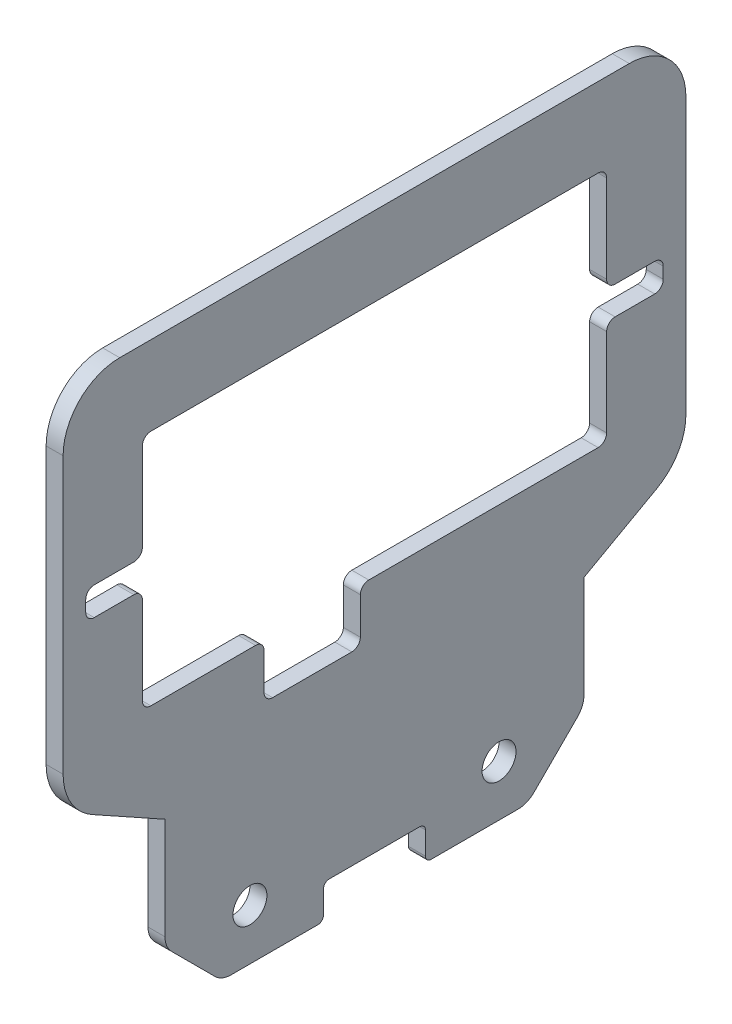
ISO-10303-21;
HEADER;
FILE_DESCRIPTION(('STEP AP214'),'2;1');
FILE_NAME('part.step','',(''),(''),'','','');
FILE_SCHEMA(('AUTOMOTIVE_DESIGN { 1 0 10303 214 1 1 1 1 }'));
ENDSEC;
DATA;
#1=APPLICATION_CONTEXT('core data for automotive mechanical design processes');
#2=APPLICATION_PROTOCOL_DEFINITION('international standard','automotive_design',2000,#1);
#3=PRODUCT_CONTEXT('',#1,'mechanical');
#4=PRODUCT('Part','Part','',(#3));
#5=PRODUCT_RELATED_PRODUCT_CATEGORY('part','',(#4));
#6=PRODUCT_DEFINITION_FORMATION('','',#4);
#7=PRODUCT_DEFINITION_CONTEXT('part definition',#1,'design');
#8=PRODUCT_DEFINITION('design','',#6,#7);
#9=PRODUCT_DEFINITION_SHAPE('','',#8);
#10=(LENGTH_UNIT() NAMED_UNIT(*) SI_UNIT(.MILLI.,.METRE.));
#11=(NAMED_UNIT(*) PLANE_ANGLE_UNIT() SI_UNIT($,.RADIAN.));
#12=(NAMED_UNIT(*) SI_UNIT($,.STERADIAN.) SOLID_ANGLE_UNIT());
#13=UNCERTAINTY_MEASURE_WITH_UNIT(LENGTH_MEASURE(1.E-05),#10,'distance_accuracy_value','');
#14=(GEOMETRIC_REPRESENTATION_CONTEXT(3) GLOBAL_UNCERTAINTY_ASSIGNED_CONTEXT((#13)) GLOBAL_UNIT_ASSIGNED_CONTEXT((#10,
#11,#12)) REPRESENTATION_CONTEXT('',''));
#15=CARTESIAN_POINT('',(0.,0.,0.));
#16=DIRECTION('',(0.,0.,1.));
#17=DIRECTION('',(1.,0.,0.));
#18=AXIS2_PLACEMENT_3D('',#15,#16,#17);
#19=CARTESIAN_POINT('',(-1.50000000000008,-34.6199111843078,-18.5));
#20=DIRECTION('',(0.,-1.,0.));
#21=DIRECTION('',(1.,0.,0.));
#22=AXIS2_PLACEMENT_3D('',#19,#20,#21);
#23=PLANE('',#22);
#24=DIRECTION('',(0.,0.,-1.));
#25=VECTOR('',#24,1.);
#26=CARTESIAN_POINT('',(-1.50000000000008,-34.6199111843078,-18.5));
#27=LINE('',#26,#25);
#28=CARTESIAN_POINT('',(-1.50000000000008,-34.6199111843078,12.6715728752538));
#29=VERTEX_POINT('',#28);
#30=CARTESIAN_POINT('',(-1.50000000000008,-34.6199111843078,5.));
#31=VERTEX_POINT('',#30);
#32=EDGE_CURVE('E536',#29,#31,#27,.T.);
#33=ORIENTED_EDGE('',*,*,#32,.T.);
#34=DIRECTION('',(1.,0.,0.));
#35=VECTOR('',#34,1.);
#36=CARTESIAN_POINT('',(0.,-34.6199111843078,5.));
#37=LINE('',#36,#35);
#38=CARTESIAN_POINT('',(0.,-34.6199111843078,5.));
#39=VERTEX_POINT('',#38);
#40=EDGE_CURVE('E656',#31,#39,#37,.T.);
#41=ORIENTED_EDGE('',*,*,#40,.T.);
#42=DIRECTION('',(0.,0.,1.));
#43=VECTOR('',#42,1.);
#44=CARTESIAN_POINT('',(0.,-34.6199111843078,0.));
#45=LINE('',#44,#43);
#46=CARTESIAN_POINT('',(0.,-34.6199111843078,12.6715728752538));
#47=VERTEX_POINT('',#46);
#48=EDGE_CURVE('E547',#47,#39,#45,.F.);
#49=ORIENTED_EDGE('',*,*,#48,.F.);
#50=DIRECTION('',(1.,0.,0.));
#51=VECTOR('',#50,1.);
#52=CARTESIAN_POINT('',(-1.50000000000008,-34.6199111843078,12.6715728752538));
#53=LINE('',#52,#51);
#54=EDGE_CURVE('E608',#47,#29,#53,.F.);
#55=ORIENTED_EDGE('',*,*,#54,.T.);
#56=EDGE_LOOP('',(#33,#41,#49,#55));
#57=FACE_BOUND('',#56,.T.);
#58=ADVANCED_FACE('F69',(#57),#23,.T.);
#59=CARTESIAN_POINT('',(-1.49999999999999,-22.1199111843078,-18.5));
#60=DIRECTION('',(0.,0.,-1.));
#61=DIRECTION('',(0.,1.,0.));
#62=AXIS2_PLACEMENT_3D('',#59,#60,#61);
#63=PLANE('',#62);
#64=DIRECTION('',(0.,-1.,0.));
#65=VECTOR('',#64,1.);
#66=CARTESIAN_POINT('',(0.,-22.1199111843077,-18.5));
#67=LINE('',#66,#65);
#68=CARTESIAN_POINT('',(0.,-28.7914840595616,-18.5));
#69=VERTEX_POINT('',#68);
#70=CARTESIAN_POINT('',(0.,-19.8,-18.5));
#71=VERTEX_POINT('',#70);
#72=EDGE_CURVE('E544',#69,#71,#67,.F.);
#73=ORIENTED_EDGE('',*,*,#72,.F.);
#74=DIRECTION('',(1.,0.,0.));
#75=VECTOR('',#74,1.);
#76=CARTESIAN_POINT('',(-1.50000000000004,-28.7914840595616,-18.5));
#77=LINE('',#76,#75);
#78=CARTESIAN_POINT('',(-1.50000000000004,-28.7914840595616,-18.5));
#79=VERTEX_POINT('',#78);
#80=EDGE_CURVE('E569',#69,#79,#77,.F.);
#81=ORIENTED_EDGE('',*,*,#80,.T.);
#82=DIRECTION('',(0.,1.,0.));
#83=VECTOR('',#82,1.);
#84=CARTESIAN_POINT('',(-1.49999999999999,-22.1199111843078,-18.5));
#85=LINE('',#84,#83);
#86=CARTESIAN_POINT('',(-1.5,-19.8,-18.5));
#87=VERTEX_POINT('',#86);
#88=EDGE_CURVE('E532',#79,#87,#85,.T.);
#89=ORIENTED_EDGE('',*,*,#88,.T.);
#90=DIRECTION('',(1.,0.,0.));
#91=VECTOR('',#90,1.);
#92=CARTESIAN_POINT('',(-1.501,-19.8,-18.5));
#93=LINE('',#92,#91);
#94=EDGE_CURVE('E450',#87,#71,#93,.T.);
#95=ORIENTED_EDGE('',*,*,#94,.T.);
#96=EDGE_LOOP('',(#73,#81,#89,#95));
#97=FACE_BOUND('',#96,.T.);
#98=ADVANCED_FACE('F1080',(#97),#63,.T.);
#99=CARTESIAN_POINT('',(-1.50000000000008,-34.6199111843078,18.5));
#100=DIRECTION('',(0.,0.,1.));
#101=DIRECTION('',(0.,-1.,0.));
#102=AXIS2_PLACEMENT_3D('',#99,#100,#101);
#103=PLANE('',#102);
#104=DIRECTION('',(0.,-1.,0.));
#105=VECTOR('',#104,1.);
#106=CARTESIAN_POINT('',(-1.50000000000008,-34.6199111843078,18.5));
#107=LINE('',#106,#105);
#108=CARTESIAN_POINT('',(-1.5,-19.8,18.5));
#109=VERTEX_POINT('',#108);
#110=CARTESIAN_POINT('',(-1.50000000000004,-28.7914840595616,18.5));
#111=VERTEX_POINT('',#110);
#112=EDGE_CURVE('E540',#109,#111,#107,.T.);
#113=ORIENTED_EDGE('',*,*,#112,.T.);
#114=DIRECTION('',(-1.,0.,0.));
#115=VECTOR('',#114,1.);
#116=CARTESIAN_POINT('',(-1.50000000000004,-28.7914840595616,18.5));
#117=LINE('',#116,#115);
#118=CARTESIAN_POINT('',(0.,-28.7914840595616,18.5));
#119=VERTEX_POINT('',#118);
#120=EDGE_CURVE('E618',#111,#119,#117,.F.);
#121=ORIENTED_EDGE('',*,*,#120,.T.);
#122=DIRECTION('',(0.,1.,0.));
#123=VECTOR('',#122,1.);
#124=CARTESIAN_POINT('',(0.,-22.1199111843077,18.5));
#125=LINE('',#124,#123);
#126=CARTESIAN_POINT('',(0.,-19.8,18.5));
#127=VERTEX_POINT('',#126);
#128=EDGE_CURVE('E520',#127,#119,#125,.F.);
#129=ORIENTED_EDGE('',*,*,#128,.F.);
#130=DIRECTION('',(1.,0.,0.));
#131=VECTOR('',#130,1.);
#132=CARTESIAN_POINT('',(-1.501,-19.8,18.5));
#133=LINE('',#132,#131);
#134=EDGE_CURVE('E459',#109,#127,#133,.T.);
#135=ORIENTED_EDGE('',*,*,#134,.F.);
#136=EDGE_LOOP('',(#113,#121,#129,#135));
#137=FACE_BOUND('',#136,.T.);
#138=ADVANCED_FACE('F701',(#137),#103,.T.);
#139=CARTESIAN_POINT('',(-1.49999999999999,-22.1199111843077,0.));
#140=DIRECTION('',(-1.,0.,0.));
#141=DIRECTION('',(0.,-1.,0.));
#142=AXIS2_PLACEMENT_3D('',#139,#140,#141);
#143=PLANE('',#142);
#144=CARTESIAN_POINT('',(-1.50000000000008,-34.6199111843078,-5.));
#145=VERTEX_POINT('',#144);
#146=CARTESIAN_POINT('',(-1.50000000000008,-34.6199111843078,-12.6715728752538));
#147=VERTEX_POINT('',#146);
#148=EDGE_CURVE('E539',#145,#147,#27,.T.);
#149=ORIENTED_EDGE('',*,*,#148,.F.);
#150=CARTESIAN_POINT('',(-1.50000000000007,-34.1199111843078,-5.));
#151=DIRECTION('',(-1.,0.,0.));
#152=DIRECTION('',(0.,-1.,0.));
#153=AXIS2_PLACEMENT_3D('',#150,#151,#152);
#154=CIRCLE('',#153,0.5);
#155=CARTESIAN_POINT('',(-1.50000000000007,-34.1199111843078,-4.5));
#156=VERTEX_POINT('',#155);
#157=EDGE_CURVE('E640',#145,#156,#154,.T.);
#158=ORIENTED_EDGE('',*,*,#157,.T.);
#159=DIRECTION('',(0.,1.,0.));
#160=VECTOR('',#159,1.);
#161=CARTESIAN_POINT('',(-1.50000000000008,-34.6199111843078,-4.5));
#162=LINE('',#161,#160);
#163=CARTESIAN_POINT('',(-1.50000000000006,-32.1199111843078,-4.5));
#164=VERTEX_POINT('',#163);
#165=EDGE_CURVE('E511',#156,#164,#162,.T.);
#166=ORIENTED_EDGE('',*,*,#165,.T.);
#167=CARTESIAN_POINT('',(-1.50000000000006,-32.1199111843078,-4.));
#168=DIRECTION('',(-1.,0.,0.));
#169=DIRECTION('',(0.,-1.,0.));
#170=AXIS2_PLACEMENT_3D('',#167,#168,#169);
#171=CIRCLE('',#170,0.5);
#172=CARTESIAN_POINT('',(-1.50000000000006,-31.6199111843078,-4.));
#173=VERTEX_POINT('',#172);
#174=EDGE_CURVE('E663',#164,#173,#171,.F.);
#175=ORIENTED_EDGE('',*,*,#174,.T.);
#176=DIRECTION('',(0.,0.,1.));
#177=VECTOR('',#176,1.);
#178=CARTESIAN_POINT('',(-1.50000000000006,-31.6199111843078,-4.5));
#179=LINE('',#178,#177);
#180=CARTESIAN_POINT('',(-1.50000000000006,-31.6199111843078,4.));
#181=VERTEX_POINT('',#180);
#182=EDGE_CURVE('E493',#173,#181,#179,.T.);
#183=ORIENTED_EDGE('',*,*,#182,.T.);
#184=CARTESIAN_POINT('',(-1.50000000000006,-32.1199111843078,4.));
#185=DIRECTION('',(-1.,0.,0.));
#186=DIRECTION('',(0.,-1.,0.));
#187=AXIS2_PLACEMENT_3D('',#184,#185,#186);
#188=CIRCLE('',#187,0.5);
#189=CARTESIAN_POINT('',(-1.50000000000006,-32.1199111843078,4.5));
#190=VERTEX_POINT('',#189);
#191=EDGE_CURVE('E13',#181,#190,#188,.F.);
#192=ORIENTED_EDGE('',*,*,#191,.T.);
#193=DIRECTION('',(0.,-1.,0.));
#194=VECTOR('',#193,1.);
#195=CARTESIAN_POINT('',(-1.50000000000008,-34.6199111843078,4.5));
#196=LINE('',#195,#194);
#197=CARTESIAN_POINT('',(-1.50000000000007,-34.1199111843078,4.5));
#198=VERTEX_POINT('',#197);
#199=EDGE_CURVE('E497',#190,#198,#196,.T.);
#200=ORIENTED_EDGE('',*,*,#199,.T.);
#201=CARTESIAN_POINT('',(-1.50000000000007,-34.1199111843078,5.));
#202=DIRECTION('',(-1.,0.,0.));
#203=DIRECTION('',(0.,-1.,0.));
#204=AXIS2_PLACEMENT_3D('',#201,#202,#203);
#205=CIRCLE('',#204,0.5);
#206=EDGE_CURVE('E85',#198,#31,#205,.T.);
#207=ORIENTED_EDGE('',*,*,#206,.T.);
#208=ORIENTED_EDGE('',*,*,#32,.F.);
#209=CARTESIAN_POINT('',(-1.50000000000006,-32.6199111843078,12.6715728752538));
#210=DIRECTION('',(-1.,0.,0.));
#211=DIRECTION('',(0.,-1.,0.));
#212=AXIS2_PLACEMENT_3D('',#209,#210,#211);
#213=CIRCLE('',#212,2.);
#214=CARTESIAN_POINT('',(-1.50000000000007,-34.0341247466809,14.0857864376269));
#215=VERTEX_POINT('',#214);
#216=EDGE_CURVE('E576',#29,#215,#213,.T.);
#217=ORIENTED_EDGE('',*,*,#216,.T.);
#218=DIRECTION('',(0.,-0.707106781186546,-0.707106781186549));
#219=VECTOR('',#218,1.);
#220=CARTESIAN_POINT('',(-1.50000000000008,-35.1199111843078,13.));
#221=LINE('',#220,#219);
#222=CARTESIAN_POINT('',(-1.50000000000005,-30.2056976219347,17.9142135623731));
#223=VERTEX_POINT('',#222);
#224=EDGE_CURVE('E565',#215,#223,#221,.F.);
#225=ORIENTED_EDGE('',*,*,#224,.T.);
#226=CARTESIAN_POINT('',(-1.50000000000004,-28.7914840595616,16.5));
#227=DIRECTION('',(-1.,0.,0.));
#228=DIRECTION('',(0.,-1.,0.));
#229=AXIS2_PLACEMENT_3D('',#226,#227,#228);
#230=CIRCLE('',#229,2.);
#231=EDGE_CURVE('E573',#223,#111,#230,.T.);
#232=ORIENTED_EDGE('',*,*,#231,.T.);
#233=ORIENTED_EDGE('',*,*,#112,.F.);
#234=DIRECTION('',(0.,-0.485642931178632,-0.874157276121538));
#235=VECTOR('',#234,1.);
#236=CARTESIAN_POINT('',(-1.5,-14.8,27.5));
#237=LINE('',#236,#235);
#238=CARTESIAN_POINT('',(-1.5,-16.2287696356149,24.9282146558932));
#239=VERTEX_POINT('',#238);
#240=EDGE_CURVE('E467',#239,#109,#237,.T.);
#241=ORIENTED_EDGE('',*,*,#240,.F.);
#242=CARTESIAN_POINT('',(-1.5,-11.8579832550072,22.5));
#243=DIRECTION('',(1.,0.,0.));
#244=DIRECTION('',(0.,0.,-1.));
#245=AXIS2_PLACEMENT_3D('',#242,#243,#244);
#246=CIRCLE('',#245,5.);
#247=CARTESIAN_POINT('',(-1.5,-11.8579832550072,27.5));
#248=VERTEX_POINT('',#247);
#249=EDGE_CURVE('E465',#239,#248,#246,.F.);
#250=ORIENTED_EDGE('',*,*,#249,.T.);
#251=DIRECTION('',(0.,-1.,0.));
#252=VECTOR('',#251,1.);
#253=CARTESIAN_POINT('',(-1.5,17.5,27.5));
#254=LINE('',#253,#252);
#255=CARTESIAN_POINT('',(-1.5,12.5,27.5));
#256=VERTEX_POINT('',#255);
#257=EDGE_CURVE('E478',#256,#248,#254,.T.);
#258=ORIENTED_EDGE('',*,*,#257,.F.);
#259=CARTESIAN_POINT('',(-1.5,12.5,22.5));
#260=DIRECTION('',(1.,0.,0.));
#261=DIRECTION('',(0.,0.,-1.));
#262=AXIS2_PLACEMENT_3D('',#259,#260,#261);
#263=CIRCLE('',#262,5.);
#264=CARTESIAN_POINT('',(-1.5,17.5,22.5));
#265=VERTEX_POINT('',#264);
#266=EDGE_CURVE('E990',#256,#265,#263,.F.);
#267=ORIENTED_EDGE('',*,*,#266,.T.);
#268=DIRECTION('',(0.,0.,1.));
#269=VECTOR('',#268,1.);
#270=CARTESIAN_POINT('',(-1.5,17.5,27.5));
#271=LINE('',#270,#269);
#272=CARTESIAN_POINT('',(-1.5,17.5,-22.5));
#273=VERTEX_POINT('',#272);
#274=EDGE_CURVE('E486',#273,#265,#271,.T.);
#275=ORIENTED_EDGE('',*,*,#274,.F.);
#276=CARTESIAN_POINT('',(-1.5,12.5,-22.5));
#277=DIRECTION('',(1.,0.,0.));
#278=DIRECTION('',(0.,0.,-1.));
#279=AXIS2_PLACEMENT_3D('',#276,#277,#278);
#280=CIRCLE('',#279,5.);
#281=CARTESIAN_POINT('',(-1.5,12.5,-27.5));
#282=VERTEX_POINT('',#281);
#283=EDGE_CURVE('E993',#273,#282,#280,.F.);
#284=ORIENTED_EDGE('',*,*,#283,.T.);
#285=DIRECTION('',(0.,1.,0.));
#286=VECTOR('',#285,1.);
#287=CARTESIAN_POINT('',(-1.5,17.5,-27.5));
#288=LINE('',#287,#286);
#289=CARTESIAN_POINT('',(-1.5,-11.8579832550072,-27.5));
#290=VERTEX_POINT('',#289);
#291=EDGE_CURVE('E719',#290,#282,#288,.T.);
#292=ORIENTED_EDGE('',*,*,#291,.F.);
#293=CARTESIAN_POINT('',(-1.5,-11.8579832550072,-22.5));
#294=DIRECTION('',(1.,0.,0.));
#295=DIRECTION('',(0.,0.,-1.));
#296=AXIS2_PLACEMENT_3D('',#293,#294,#295);
#297=CIRCLE('',#296,5.);
#298=CARTESIAN_POINT('',(-1.5,-16.2287696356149,-24.9282146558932));
#299=VERTEX_POINT('',#298);
#300=EDGE_CURVE('E985',#290,#299,#297,.F.);
#301=ORIENTED_EDGE('',*,*,#300,.T.);
#302=DIRECTION('',(0.,0.485642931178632,-0.874157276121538));
#303=VECTOR('',#302,1.);
#304=CARTESIAN_POINT('',(-1.5,-14.8,-27.5));
#305=LINE('',#304,#303);
#306=EDGE_CURVE('E703',#87,#299,#305,.T.);
#307=ORIENTED_EDGE('',*,*,#306,.F.);
#308=ORIENTED_EDGE('',*,*,#88,.F.);
#309=CARTESIAN_POINT('',(-1.50000000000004,-28.7914840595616,-16.5));
#310=DIRECTION('',(-1.,0.,0.));
#311=DIRECTION('',(0.,-1.,0.));
#312=AXIS2_PLACEMENT_3D('',#309,#310,#311);
#313=CIRCLE('',#312,2.);
#314=CARTESIAN_POINT('',(-1.50000000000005,-30.2056976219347,-17.9142135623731));
#315=VERTEX_POINT('',#314);
#316=EDGE_CURVE('E583',#79,#315,#313,.T.);
#317=ORIENTED_EDGE('',*,*,#316,.T.);
#318=DIRECTION('',(0.,0.707106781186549,-0.707106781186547));
#319=VECTOR('',#318,1.);
#320=CARTESIAN_POINT('',(-1.50000000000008,-35.1199111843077,-13.0000000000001));
#321=LINE('',#320,#319);
#322=CARTESIAN_POINT('',(-1.50000000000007,-34.0341247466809,-14.0857864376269));
#323=VERTEX_POINT('',#322);
#324=EDGE_CURVE('E561',#315,#323,#321,.F.);
#325=ORIENTED_EDGE('',*,*,#324,.T.);
#326=CARTESIAN_POINT('',(-1.50000000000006,-32.6199111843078,-12.6715728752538));
#327=DIRECTION('',(-1.,0.,0.));
#328=DIRECTION('',(0.,-1.,0.));
#329=AXIS2_PLACEMENT_3D('',#326,#327,#328);
#330=CIRCLE('',#329,2.);
#331=EDGE_CURVE('E579',#323,#147,#330,.T.);
#332=ORIENTED_EDGE('',*,*,#331,.T.);
#333=EDGE_LOOP('',(#149,#158,#166,#175,#183,#192,#200,#207,#208,#217,#225,#232,#233,#241,#250,
#258,#267,#275,#284,#292,#301,#307,#308,#317,#325,#332));
#334=FACE_BOUND('',#333,.T.);
#335=CARTESIAN_POINT('',(-1.50000000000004,-30.1199111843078,-11.));
#336=DIRECTION('',(-1.,0.,0.));
#337=DIRECTION('',(0.,-1.,0.));
#338=AXIS2_PLACEMENT_3D('',#335,#336,#337);
#339=CIRCLE('',#338,1.5);
#340=CARTESIAN_POINT('',(-1.50000000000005,-31.6199111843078,-11.));
#341=VERTEX_POINT('',#340);
#342=EDGE_CURVE('E521',#341,#341,#339,.F.);
#343=ORIENTED_EDGE('',*,*,#342,.T.);
#344=EDGE_LOOP('',(#343));
#345=FACE_BOUND('',#344,.T.);
#346=CARTESIAN_POINT('',(-1.50000000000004,-30.1199111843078,11.));
#347=DIRECTION('',(-1.,0.,0.));
#348=DIRECTION('',(0.,-1.,0.));
#349=AXIS2_PLACEMENT_3D('',#346,#347,#348);
#350=CIRCLE('',#349,1.5);
#351=CARTESIAN_POINT('',(-1.50000000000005,-31.6199111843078,11.));
#352=VERTEX_POINT('',#351);
#353=EDGE_CURVE('E525',#352,#352,#350,.F.);
#354=ORIENTED_EDGE('',*,*,#353,.T.);
#355=EDGE_LOOP('',(#354));
#356=FACE_BOUND('',#355,.T.);
#357=DIRECTION('',(0.,0.,-1.));
#358=VECTOR('',#357,1.);
#359=CARTESIAN_POINT('',(-1.5,-10.5,-20.5));
#360=LINE('',#359,#358);
#361=CARTESIAN_POINT('',(-1.5,-10.5,19.75));
#362=VERTEX_POINT('',#361);
#363=CARTESIAN_POINT('',(-1.5,-10.5,10.5));
#364=VERTEX_POINT('',#363);
#365=EDGE_CURVE('E918',#362,#364,#360,.T.);
#366=ORIENTED_EDGE('',*,*,#365,.T.);
#367=CARTESIAN_POINT('',(-1.5,-11.25,10.5));
#368=DIRECTION('',(1.,0.,0.));
#369=DIRECTION('',(0.,0.,-1.));
#370=AXIS2_PLACEMENT_3D('',#367,#368,#369);
#371=CIRCLE('',#370,0.75);
#372=CARTESIAN_POINT('',(-1.5,-11.25,9.75));
#373=VERTEX_POINT('',#372);
#374=EDGE_CURVE('E919',#364,#373,#371,.F.);
#375=ORIENTED_EDGE('',*,*,#374,.T.);
#376=DIRECTION('',(0.,1.,0.));
#377=VECTOR('',#376,1.);
#378=CARTESIAN_POINT('',(-1.5,-10.5,9.75));
#379=LINE('',#378,#377);
#380=CARTESIAN_POINT('',(-1.5,-14.5,9.75));
#381=VERTEX_POINT('',#380);
#382=EDGE_CURVE('E899',#381,#373,#379,.T.);
#383=ORIENTED_EDGE('',*,*,#382,.F.);
#384=CARTESIAN_POINT('',(-1.5,-14.5,9.));
#385=DIRECTION('',(1.,0.,0.));
#386=DIRECTION('',(0.,0.,-1.));
#387=AXIS2_PLACEMENT_3D('',#384,#385,#386);
#388=CIRCLE('',#387,0.75);
#389=CARTESIAN_POINT('',(-1.5,-15.25,9.));
#390=VERTEX_POINT('',#389);
#391=EDGE_CURVE('E922',#381,#390,#388,.T.);
#392=ORIENTED_EDGE('',*,*,#391,.T.);
#393=DIRECTION('',(0.,0.,1.));
#394=VECTOR('',#393,1.);
#395=CARTESIAN_POINT('',(-1.5,-15.25,1.25));
#396=LINE('',#395,#394);
#397=CARTESIAN_POINT('',(-1.5,-15.25,2.));
#398=VERTEX_POINT('',#397);
#399=EDGE_CURVE('E884',#398,#390,#396,.T.);
#400=ORIENTED_EDGE('',*,*,#399,.F.);
#401=CARTESIAN_POINT('',(-1.5,-14.5,2.));
#402=DIRECTION('',(1.,0.,0.));
#403=DIRECTION('',(0.,0.,-1.));
#404=AXIS2_PLACEMENT_3D('',#401,#402,#403);
#405=CIRCLE('',#404,0.75);
#406=CARTESIAN_POINT('',(-1.5,-14.5,1.25));
#407=VERTEX_POINT('',#406);
#408=EDGE_CURVE('E925',#398,#407,#405,.T.);
#409=ORIENTED_EDGE('',*,*,#408,.T.);
#410=DIRECTION('',(0.,-1.,0.));
#411=VECTOR('',#410,1.);
#412=CARTESIAN_POINT('',(-1.5,-10.5,1.25));
#413=LINE('',#412,#411);
#414=CARTESIAN_POINT('',(-1.5,-11.25,1.25));
#415=VERTEX_POINT('',#414);
#416=EDGE_CURVE('E873',#415,#407,#413,.T.);
#417=ORIENTED_EDGE('',*,*,#416,.F.);
#418=CARTESIAN_POINT('',(-1.5,-11.25,0.499999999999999));
#419=DIRECTION('',(1.,0.,0.));
#420=DIRECTION('',(0.,0.,-1.));
#421=AXIS2_PLACEMENT_3D('',#418,#419,#420);
#422=CIRCLE('',#421,0.75);
#423=CARTESIAN_POINT('',(-1.5,-10.5,0.5));
#424=VERTEX_POINT('',#423);
#425=EDGE_CURVE('E928',#415,#424,#422,.F.);
#426=ORIENTED_EDGE('',*,*,#425,.T.);
#427=CARTESIAN_POINT('',(-1.5,-10.5,-19.75));
#428=VERTEX_POINT('',#427);
#429=EDGE_CURVE('E931',#424,#428,#360,.T.);
#430=ORIENTED_EDGE('',*,*,#429,.T.);
#431=CARTESIAN_POINT('',(-1.5,-9.75,-19.75));
#432=DIRECTION('',(1.,0.,0.));
#433=DIRECTION('',(0.,0.,-1.));
#434=AXIS2_PLACEMENT_3D('',#431,#432,#433);
#435=CIRCLE('',#434,0.75);
#436=CARTESIAN_POINT('',(-1.5,-9.75,-20.5));
#437=VERTEX_POINT('',#436);
#438=EDGE_CURVE('E935',#428,#437,#435,.T.);
#439=ORIENTED_EDGE('',*,*,#438,.T.);
#440=DIRECTION('',(0.,1.,0.));
#441=VECTOR('',#440,1.);
#442=CARTESIAN_POINT('',(-1.5,-10.5,-20.5));
#443=LINE('',#442,#441);
#444=CARTESIAN_POINT('',(-1.5,-2.,-20.5));
#445=VERTEX_POINT('',#444);
#446=EDGE_CURVE('E938',#437,#445,#443,.T.);
#447=ORIENTED_EDGE('',*,*,#446,.T.);
#448=CARTESIAN_POINT('',(-1.5,-2.,-21.25));
#449=DIRECTION('',(1.,0.,0.));
#450=DIRECTION('',(0.,0.,-1.));
#451=AXIS2_PLACEMENT_3D('',#448,#449,#450);
#452=CIRCLE('',#451,0.75);
#453=CARTESIAN_POINT('',(-1.5,-1.25,-21.25));
#454=VERTEX_POINT('',#453);
#455=EDGE_CURVE('E939',#445,#454,#452,.F.);
#456=ORIENTED_EDGE('',*,*,#455,.T.);
#457=DIRECTION('',(0.,0.,1.));
#458=VECTOR('',#457,1.);
#459=CARTESIAN_POINT('',(-1.5,-1.25,-25.5));
#460=LINE('',#459,#458);
#461=CARTESIAN_POINT('',(-1.5,-1.25,-24.75));
#462=VERTEX_POINT('',#461);
#463=EDGE_CURVE('E840',#462,#454,#460,.T.);
#464=ORIENTED_EDGE('',*,*,#463,.F.);
#465=CARTESIAN_POINT('',(-1.5,-0.5,-24.75));
#466=DIRECTION('',(1.,0.,0.));
#467=DIRECTION('',(0.,0.,-1.));
#468=AXIS2_PLACEMENT_3D('',#465,#466,#467);
#469=CIRCLE('',#468,0.75);
#470=CARTESIAN_POINT('',(-1.5,-0.5,-25.5));
#471=VERTEX_POINT('',#470);
#472=EDGE_CURVE('E942',#462,#471,#469,.T.);
#473=ORIENTED_EDGE('',*,*,#472,.T.);
#474=DIRECTION('',(0.,-1.,0.));
#475=VECTOR('',#474,1.);
#476=CARTESIAN_POINT('',(-1.5,-1.25,-25.5));
#477=LINE('',#476,#475);
#478=CARTESIAN_POINT('',(-1.5,0.5,-25.5));
#479=VERTEX_POINT('',#478);
#480=EDGE_CURVE('E832',#479,#471,#477,.T.);
#481=ORIENTED_EDGE('',*,*,#480,.F.);
#482=CARTESIAN_POINT('',(-1.5,0.5,-24.75));
#483=DIRECTION('',(1.,0.,0.));
#484=DIRECTION('',(0.,0.,-1.));
#485=AXIS2_PLACEMENT_3D('',#482,#483,#484);
#486=CIRCLE('',#485,0.75);
#487=CARTESIAN_POINT('',(-1.5,1.25,-24.75));
#488=VERTEX_POINT('',#487);
#489=EDGE_CURVE('E945',#479,#488,#486,.T.);
#490=ORIENTED_EDGE('',*,*,#489,.T.);
#491=DIRECTION('',(0.,0.,-1.));
#492=VECTOR('',#491,1.);
#493=CARTESIAN_POINT('',(-1.5,1.25,-25.5));
#494=LINE('',#493,#492);
#495=CARTESIAN_POINT('',(-1.5,1.25,-21.25));
#496=VERTEX_POINT('',#495);
#497=EDGE_CURVE('E817',#496,#488,#494,.T.);
#498=ORIENTED_EDGE('',*,*,#497,.F.);
#499=CARTESIAN_POINT('',(-1.5,2.,-21.25));
#500=DIRECTION('',(1.,0.,0.));
#501=DIRECTION('',(0.,0.,-1.));
#502=AXIS2_PLACEMENT_3D('',#499,#500,#501);
#503=CIRCLE('',#502,0.75);
#504=CARTESIAN_POINT('',(-1.5,2.,-20.5));
#505=VERTEX_POINT('',#504);
#506=EDGE_CURVE('E948',#496,#505,#503,.F.);
#507=ORIENTED_EDGE('',*,*,#506,.T.);
#508=CARTESIAN_POINT('',(-1.5,9.75000000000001,-20.5));
#509=VERTEX_POINT('',#508);
#510=EDGE_CURVE('E951',#505,#509,#443,.T.);
#511=ORIENTED_EDGE('',*,*,#510,.T.);
#512=CARTESIAN_POINT('',(-1.5,9.75,-19.75));
#513=DIRECTION('',(1.,0.,0.));
#514=DIRECTION('',(0.,0.,-1.));
#515=AXIS2_PLACEMENT_3D('',#512,#513,#514);
#516=CIRCLE('',#515,0.75);
#517=CARTESIAN_POINT('',(-1.5,10.5,-19.75));
#518=VERTEX_POINT('',#517);
#519=EDGE_CURVE('E955',#509,#518,#516,.T.);
#520=ORIENTED_EDGE('',*,*,#519,.T.);
#521=DIRECTION('',(0.,0.,1.));
#522=VECTOR('',#521,1.);
#523=CARTESIAN_POINT('',(-1.5,10.5,-20.5));
#524=LINE('',#523,#522);
#525=CARTESIAN_POINT('',(-1.5,10.5,19.75));
#526=VERTEX_POINT('',#525);
#527=EDGE_CURVE('E958',#518,#526,#524,.T.);
#528=ORIENTED_EDGE('',*,*,#527,.T.);
#529=CARTESIAN_POINT('',(-1.5,9.75,19.75));
#530=DIRECTION('',(1.,0.,0.));
#531=DIRECTION('',(0.,0.,-1.));
#532=AXIS2_PLACEMENT_3D('',#529,#530,#531);
#533=CIRCLE('',#532,0.75);
#534=CARTESIAN_POINT('',(-1.5,9.74999999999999,20.5));
#535=VERTEX_POINT('',#534);
#536=EDGE_CURVE('E962',#526,#535,#533,.T.);
#537=ORIENTED_EDGE('',*,*,#536,.T.);
#538=DIRECTION('',(0.,-1.,0.));
#539=VECTOR('',#538,1.);
#540=CARTESIAN_POINT('',(-1.5,-10.5,20.5));
#541=LINE('',#540,#539);
#542=CARTESIAN_POINT('',(-1.5,2.,20.5));
#543=VERTEX_POINT('',#542);
#544=EDGE_CURVE('E965',#535,#543,#541,.T.);
#545=ORIENTED_EDGE('',*,*,#544,.T.);
#546=CARTESIAN_POINT('',(-1.5,2.,21.25));
#547=DIRECTION('',(1.,0.,0.));
#548=DIRECTION('',(0.,0.,-1.));
#549=AXIS2_PLACEMENT_3D('',#546,#547,#548);
#550=CIRCLE('',#549,0.75);
#551=CARTESIAN_POINT('',(-1.5,1.25,21.25));
#552=VERTEX_POINT('',#551);
#553=EDGE_CURVE('E966',#543,#552,#550,.F.);
#554=ORIENTED_EDGE('',*,*,#553,.T.);
#555=DIRECTION('',(0.,0.,-1.));
#556=VECTOR('',#555,1.);
#557=CARTESIAN_POINT('',(-1.5,1.25,-25.5));
#558=LINE('',#557,#556);
#559=CARTESIAN_POINT('',(-1.5,1.25,24.75));
#560=VERTEX_POINT('',#559);
#561=EDGE_CURVE('E772',#560,#552,#558,.T.);
#562=ORIENTED_EDGE('',*,*,#561,.F.);
#563=CARTESIAN_POINT('',(-1.5,0.5,24.75));
#564=DIRECTION('',(1.,0.,0.));
#565=DIRECTION('',(0.,0.,-1.));
#566=AXIS2_PLACEMENT_3D('',#563,#564,#565);
#567=CIRCLE('',#566,0.75);
#568=CARTESIAN_POINT('',(-1.5,0.5,25.5));
#569=VERTEX_POINT('',#568);
#570=EDGE_CURVE('E969',#560,#569,#567,.T.);
#571=ORIENTED_EDGE('',*,*,#570,.T.);
#572=DIRECTION('',(0.,1.,0.));
#573=VECTOR('',#572,1.);
#574=CARTESIAN_POINT('',(-1.5,-1.25,25.5));
#575=LINE('',#574,#573);
#576=CARTESIAN_POINT('',(-1.5,-0.5,25.5));
#577=VERTEX_POINT('',#576);
#578=EDGE_CURVE('E750',#577,#569,#575,.T.);
#579=ORIENTED_EDGE('',*,*,#578,.F.);
#580=CARTESIAN_POINT('',(-1.5,-0.5,24.75));
#581=DIRECTION('',(1.,0.,0.));
#582=DIRECTION('',(0.,0.,-1.));
#583=AXIS2_PLACEMENT_3D('',#580,#581,#582);
#584=CIRCLE('',#583,0.75);
#585=CARTESIAN_POINT('',(-1.5,-1.25,24.75));
#586=VERTEX_POINT('',#585);
#587=EDGE_CURVE('E972',#577,#586,#584,.T.);
#588=ORIENTED_EDGE('',*,*,#587,.T.);
#589=DIRECTION('',(0.,0.,1.));
#590=VECTOR('',#589,1.);
#591=CARTESIAN_POINT('',(-1.5,-1.25,-25.5));
#592=LINE('',#591,#590);
#593=CARTESIAN_POINT('',(-1.5,-1.25,21.25));
#594=VERTEX_POINT('',#593);
#595=EDGE_CURVE('E734',#594,#586,#592,.T.);
#596=ORIENTED_EDGE('',*,*,#595,.F.);
#597=CARTESIAN_POINT('',(-1.5,-2.,21.25));
#598=DIRECTION('',(1.,0.,0.));
#599=DIRECTION('',(0.,0.,-1.));
#600=AXIS2_PLACEMENT_3D('',#597,#598,#599);
#601=CIRCLE('',#600,0.75);
#602=CARTESIAN_POINT('',(-1.5,-2.,20.5));
#603=VERTEX_POINT('',#602);
#604=EDGE_CURVE('E975',#594,#603,#601,.F.);
#605=ORIENTED_EDGE('',*,*,#604,.T.);
#606=CARTESIAN_POINT('',(-1.5,-9.75,20.5));
#607=VERTEX_POINT('',#606);
#608=EDGE_CURVE('E978',#603,#607,#541,.T.);
#609=ORIENTED_EDGE('',*,*,#608,.T.);
#610=CARTESIAN_POINT('',(-1.5,-9.75,19.75));
#611=DIRECTION('',(1.,0.,0.));
#612=DIRECTION('',(0.,0.,-1.));
#613=AXIS2_PLACEMENT_3D('',#610,#611,#612);
#614=CIRCLE('',#613,0.75);
#615=EDGE_CURVE('E982',#607,#362,#614,.T.);
#616=ORIENTED_EDGE('',*,*,#615,.T.);
#617=EDGE_LOOP('',(#366,#375,#383,#392,#400,#409,#417,#426,#430,#439,#447,#456,#464,#473,#481,
#490,#498,#507,#511,#520,#528,#537,#545,#554,#562,#571,#579,#588,#596,#605,#609,#616));
#618=FACE_BOUND('',#617,.T.);
#619=ADVANCED_FACE('F678',(#334,#345,#356,#618),#143,.T.);
#620=CARTESIAN_POINT('',(0.,0.,0.));
#621=DIRECTION('',(1.,0.,0.));
#622=DIRECTION('',(0.,0.,-1.));
#623=AXIS2_PLACEMENT_3D('',#620,#621,#622);
#624=PLANE('',#623);
#625=CARTESIAN_POINT('',(0.,-30.1199111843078,-11.));
#626=DIRECTION('',(1.,0.,0.));
#627=DIRECTION('',(0.,1.,0.));
#628=AXIS2_PLACEMENT_3D('',#625,#626,#627);
#629=CIRCLE('',#628,1.5);
#630=CARTESIAN_POINT('',(0.,-28.6199111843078,-11.));
#631=VERTEX_POINT('',#630);
#632=EDGE_CURVE('E516',#631,#631,#629,.T.);
#633=ORIENTED_EDGE('',*,*,#632,.F.);
#634=EDGE_LOOP('',(#633));
#635=FACE_BOUND('',#634,.T.);
#636=CARTESIAN_POINT('',(0.,-30.1199111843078,11.));
#637=DIRECTION('',(1.,0.,0.));
#638=DIRECTION('',(0.,1.,0.));
#639=AXIS2_PLACEMENT_3D('',#636,#637,#638);
#640=CIRCLE('',#639,1.5);
#641=CARTESIAN_POINT('',(0.,-28.6199111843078,11.));
#642=VERTEX_POINT('',#641);
#643=EDGE_CURVE('E515',#642,#642,#640,.T.);
#644=ORIENTED_EDGE('',*,*,#643,.F.);
#645=EDGE_LOOP('',(#644));
#646=FACE_BOUND('',#645,.T.);
#647=DIRECTION('',(0.,1.,0.));
#648=VECTOR('',#647,1.);
#649=CARTESIAN_POINT('',(0.,-34.6199111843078,-4.5));
#650=LINE('',#649,#648);
#651=CARTESIAN_POINT('',(0.,-34.1199111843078,-4.5));
#652=VERTEX_POINT('',#651);
#653=CARTESIAN_POINT('',(0.,-32.1199111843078,-4.5));
#654=VERTEX_POINT('',#653);
#655=EDGE_CURVE('E500',#652,#654,#650,.T.);
#656=ORIENTED_EDGE('',*,*,#655,.F.);
#657=CARTESIAN_POINT('',(0.,-34.1199111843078,-5.));
#658=DIRECTION('',(-1.,0.,0.));
#659=DIRECTION('',(0.,-1.,0.));
#660=AXIS2_PLACEMENT_3D('',#657,#658,#659);
#661=CIRCLE('',#660,0.5);
#662=CARTESIAN_POINT('',(0.,-34.6199111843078,-5.));
#663=VERTEX_POINT('',#662);
#664=EDGE_CURVE('E632',#652,#663,#661,.F.);
#665=ORIENTED_EDGE('',*,*,#664,.T.);
#666=CARTESIAN_POINT('',(0.,-34.6199111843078,-12.6715728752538));
#667=VERTEX_POINT('',#666);
#668=EDGE_CURVE('E551',#663,#667,#45,.F.);
#669=ORIENTED_EDGE('',*,*,#668,.T.);
#670=CARTESIAN_POINT('',(0.,-32.6199111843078,-12.6715728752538));
#671=DIRECTION('',(-1.,0.,0.));
#672=DIRECTION('',(0.,-1.,0.));
#673=AXIS2_PLACEMENT_3D('',#670,#671,#672);
#674=CIRCLE('',#673,2.);
#675=CARTESIAN_POINT('',(0.,-34.0341247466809,-14.0857864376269));
#676=VERTEX_POINT('',#675);
#677=EDGE_CURVE('E598',#667,#676,#674,.F.);
#678=ORIENTED_EDGE('',*,*,#677,.T.);
#679=DIRECTION('',(0.,-0.707106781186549,0.707106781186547));
#680=VECTOR('',#679,1.);
#681=CARTESIAN_POINT('',(0.,-34.6199111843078,-13.5));
#682=LINE('',#681,#680);
#683=CARTESIAN_POINT('',(0.,-30.2056976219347,-17.9142135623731));
#684=VERTEX_POINT('',#683);
#685=EDGE_CURVE('E535',#676,#684,#682,.F.);
#686=ORIENTED_EDGE('',*,*,#685,.T.);
#687=CARTESIAN_POINT('',(0.,-28.7914840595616,-16.5));
#688=DIRECTION('',(-1.,0.,0.));
#689=DIRECTION('',(0.,-1.,0.));
#690=AXIS2_PLACEMENT_3D('',#687,#688,#689);
#691=CIRCLE('',#690,2.);
#692=EDGE_CURVE('E601',#684,#69,#691,.F.);
#693=ORIENTED_EDGE('',*,*,#692,.T.);
#694=ORIENTED_EDGE('',*,*,#72,.T.);
#695=DIRECTION('',(0.,-0.485642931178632,0.874157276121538));
#696=VECTOR('',#695,1.);
#697=CARTESIAN_POINT('',(0.,-14.8,-27.5));
#698=LINE('',#697,#696);
#699=CARTESIAN_POINT('',(0.,-16.2287696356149,-24.9282146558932));
#700=VERTEX_POINT('',#699);
#701=EDGE_CURVE('E712',#700,#71,#698,.T.);
#702=ORIENTED_EDGE('',*,*,#701,.F.);
#703=CARTESIAN_POINT('',(0.,-11.8579832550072,-22.5));
#704=DIRECTION('',(1.,0.,0.));
#705=DIRECTION('',(0.,0.,-1.));
#706=AXIS2_PLACEMENT_3D('',#703,#704,#705);
#707=CIRCLE('',#706,5.);
#708=CARTESIAN_POINT('',(0.,-11.8579832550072,-27.5));
#709=VERTEX_POINT('',#708);
#710=EDGE_CURVE('E1056',#700,#709,#707,.T.);
#711=ORIENTED_EDGE('',*,*,#710,.T.);
#712=DIRECTION('',(0.,1.,0.));
#713=VECTOR('',#712,1.);
#714=CARTESIAN_POINT('',(0.,17.5,-27.5));
#715=LINE('',#714,#713);
#716=CARTESIAN_POINT('',(0.,12.5,-27.5));
#717=VERTEX_POINT('',#716);
#718=EDGE_CURVE('E1059',#709,#717,#715,.T.);
#719=ORIENTED_EDGE('',*,*,#718,.T.);
#720=CARTESIAN_POINT('',(0.,12.5,-22.5));
#721=DIRECTION('',(1.,0.,0.));
#722=DIRECTION('',(0.,0.,-1.));
#723=AXIS2_PLACEMENT_3D('',#720,#721,#722);
#724=CIRCLE('',#723,5.);
#725=CARTESIAN_POINT('',(0.,17.5,-22.5));
#726=VERTEX_POINT('',#725);
#727=EDGE_CURVE('E1063',#717,#726,#724,.T.);
#728=ORIENTED_EDGE('',*,*,#727,.T.);
#729=DIRECTION('',(0.,0.,1.));
#730=VECTOR('',#729,1.);
#731=CARTESIAN_POINT('',(0.,17.5,27.5));
#732=LINE('',#731,#730);
#733=CARTESIAN_POINT('',(0.,17.5,22.5));
#734=VERTEX_POINT('',#733);
#735=EDGE_CURVE('E1066',#726,#734,#732,.T.);
#736=ORIENTED_EDGE('',*,*,#735,.T.);
#737=CARTESIAN_POINT('',(0.,12.5,22.5));
#738=DIRECTION('',(1.,0.,0.));
#739=DIRECTION('',(0.,0.,-1.));
#740=AXIS2_PLACEMENT_3D('',#737,#738,#739);
#741=CIRCLE('',#740,5.);
#742=CARTESIAN_POINT('',(0.,12.5,27.5));
#743=VERTEX_POINT('',#742);
#744=EDGE_CURVE('E1070',#734,#743,#741,.T.);
#745=ORIENTED_EDGE('',*,*,#744,.T.);
#746=DIRECTION('',(0.,-1.,0.));
#747=VECTOR('',#746,1.);
#748=CARTESIAN_POINT('',(0.,17.5,27.5));
#749=LINE('',#748,#747);
#750=CARTESIAN_POINT('',(0.,-11.8579832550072,27.5));
#751=VERTEX_POINT('',#750);
#752=EDGE_CURVE('E444',#743,#751,#749,.T.);
#753=ORIENTED_EDGE('',*,*,#752,.T.);
#754=CARTESIAN_POINT('',(0.,-11.8579832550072,22.5));
#755=DIRECTION('',(1.,0.,0.));
#756=DIRECTION('',(0.,0.,-1.));
#757=AXIS2_PLACEMENT_3D('',#754,#755,#756);
#758=CIRCLE('',#757,5.);
#759=CARTESIAN_POINT('',(0.,-16.2287696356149,24.9282146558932));
#760=VERTEX_POINT('',#759);
#761=EDGE_CURVE('E437',#751,#760,#758,.T.);
#762=ORIENTED_EDGE('',*,*,#761,.T.);
#763=DIRECTION('',(0.,0.485642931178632,0.874157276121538));
#764=VECTOR('',#763,1.);
#765=CARTESIAN_POINT('',(0.,-14.8,27.5));
#766=LINE('',#765,#764);
#767=EDGE_CURVE('E442',#127,#760,#766,.T.);
#768=ORIENTED_EDGE('',*,*,#767,.F.);
#769=ORIENTED_EDGE('',*,*,#128,.T.);
#770=CARTESIAN_POINT('',(0.,-28.7914840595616,16.5));
#771=DIRECTION('',(-1.,0.,0.));
#772=DIRECTION('',(0.,-1.,0.));
#773=AXIS2_PLACEMENT_3D('',#770,#771,#772);
#774=CIRCLE('',#773,2.);
#775=CARTESIAN_POINT('',(0.,-30.2056976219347,17.9142135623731));
#776=VERTEX_POINT('',#775);
#777=EDGE_CURVE('E592',#119,#776,#774,.F.);
#778=ORIENTED_EDGE('',*,*,#777,.T.);
#779=DIRECTION('',(0.,0.707106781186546,0.707106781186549));
#780=VECTOR('',#779,1.);
#781=CARTESIAN_POINT('',(0.,-29.6199111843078,18.5));
#782=LINE('',#781,#780);
#783=CARTESIAN_POINT('',(0.,-34.0341247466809,14.0857864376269));
#784=VERTEX_POINT('',#783);
#785=EDGE_CURVE('E557',#776,#784,#782,.F.);
#786=ORIENTED_EDGE('',*,*,#785,.T.);
#787=CARTESIAN_POINT('',(0.,-32.6199111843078,12.6715728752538));
#788=DIRECTION('',(-1.,0.,0.));
#789=DIRECTION('',(0.,-1.,0.));
#790=AXIS2_PLACEMENT_3D('',#787,#788,#789);
#791=CIRCLE('',#790,2.);
#792=EDGE_CURVE('E595',#784,#47,#791,.F.);
#793=ORIENTED_EDGE('',*,*,#792,.T.);
#794=ORIENTED_EDGE('',*,*,#48,.T.);
#795=CARTESIAN_POINT('',(0.,-34.1199111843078,5.));
#796=DIRECTION('',(-1.,0.,0.));
#797=DIRECTION('',(0.,-1.,0.));
#798=AXIS2_PLACEMENT_3D('',#795,#796,#797);
#799=CIRCLE('',#798,0.5);
#800=CARTESIAN_POINT('',(0.,-34.1199111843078,4.5));
#801=VERTEX_POINT('',#800);
#802=EDGE_CURVE('E629',#39,#801,#799,.F.);
#803=ORIENTED_EDGE('',*,*,#802,.T.);
#804=DIRECTION('',(0.,-1.,0.));
#805=VECTOR('',#804,1.);
#806=CARTESIAN_POINT('',(0.,-34.6199111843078,4.5));
#807=LINE('',#806,#805);
#808=CARTESIAN_POINT('',(0.,-32.1199111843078,4.5));
#809=VERTEX_POINT('',#808);
#810=EDGE_CURVE('E508',#809,#801,#807,.T.);
#811=ORIENTED_EDGE('',*,*,#810,.F.);
#812=CARTESIAN_POINT('',(0.,-32.1199111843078,4.));
#813=DIRECTION('',(-1.,0.,0.));
#814=DIRECTION('',(0.,-1.,0.));
#815=AXIS2_PLACEMENT_3D('',#812,#813,#814);
#816=CIRCLE('',#815,0.5);
#817=CARTESIAN_POINT('',(0.,-31.6199111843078,4.));
#818=VERTEX_POINT('',#817);
#819=EDGE_CURVE('E78',#809,#818,#816,.T.);
#820=ORIENTED_EDGE('',*,*,#819,.T.);
#821=DIRECTION('',(0.,0.,1.));
#822=VECTOR('',#821,1.);
#823=CARTESIAN_POINT('',(0.,-31.6199111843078,-4.5));
#824=LINE('',#823,#822);
#825=CARTESIAN_POINT('',(0.,-31.6199111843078,-4.));
#826=VERTEX_POINT('',#825);
#827=EDGE_CURVE('E504',#826,#818,#824,.T.);
#828=ORIENTED_EDGE('',*,*,#827,.F.);
#829=CARTESIAN_POINT('',(0.,-32.1199111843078,-4.));
#830=DIRECTION('',(-1.,0.,0.));
#831=DIRECTION('',(0.,-1.,0.));
#832=AXIS2_PLACEMENT_3D('',#829,#830,#831);
#833=CIRCLE('',#832,0.5);
#834=EDGE_CURVE('E660',#826,#654,#833,.T.);
#835=ORIENTED_EDGE('',*,*,#834,.T.);
#836=EDGE_LOOP('',(#656,#665,#669,#678,#686,#693,#694,#702,#711,#719,#728,#736,#745,#753,#762,
#768,#769,#778,#786,#793,#794,#803,#811,#820,#828,#835));
#837=FACE_BOUND('',#836,.T.);
#838=DIRECTION('',(0.,1.,0.));
#839=VECTOR('',#838,1.);
#840=CARTESIAN_POINT('',(0.,-10.5,9.75));
#841=LINE('',#840,#839);
#842=CARTESIAN_POINT('',(0.,-14.5,9.75));
#843=VERTEX_POINT('',#842);
#844=CARTESIAN_POINT('',(0.,-11.25,9.75));
#845=VERTEX_POINT('',#844);
#846=EDGE_CURVE('E996',#843,#845,#841,.T.);
#847=ORIENTED_EDGE('',*,*,#846,.T.);
#848=CARTESIAN_POINT('',(0.,-11.25,10.5));
#849=DIRECTION('',(1.,0.,0.));
#850=DIRECTION('',(0.,0.,-1.));
#851=AXIS2_PLACEMENT_3D('',#848,#849,#850);
#852=CIRCLE('',#851,0.75);
#853=CARTESIAN_POINT('',(0.,-10.5,10.5));
#854=VERTEX_POINT('',#853);
#855=EDGE_CURVE('E1000',#845,#854,#852,.T.);
#856=ORIENTED_EDGE('',*,*,#855,.T.);
#857=DIRECTION('',(0.,0.,-1.));
#858=VECTOR('',#857,1.);
#859=CARTESIAN_POINT('',(0.,-10.5,-20.5));
#860=LINE('',#859,#858);
#861=CARTESIAN_POINT('',(0.,-10.5,19.75));
#862=VERTEX_POINT('',#861);
#863=EDGE_CURVE('E906',#862,#854,#860,.T.);
#864=ORIENTED_EDGE('',*,*,#863,.F.);
#865=CARTESIAN_POINT('',(0.,-9.75,19.75));
#866=DIRECTION('',(1.,0.,0.));
#867=DIRECTION('',(0.,0.,-1.));
#868=AXIS2_PLACEMENT_3D('',#865,#866,#867);
#869=CIRCLE('',#868,0.75);
#870=CARTESIAN_POINT('',(0.,-9.75,20.5));
#871=VERTEX_POINT('',#870);
#872=EDGE_CURVE('E1003',#862,#871,#869,.F.);
#873=ORIENTED_EDGE('',*,*,#872,.T.);
#874=DIRECTION('',(0.,-1.,0.));
#875=VECTOR('',#874,1.);
#876=CARTESIAN_POINT('',(0.,-10.5,20.5));
#877=LINE('',#876,#875);
#878=CARTESIAN_POINT('',(0.,-2.,20.5));
#879=VERTEX_POINT('',#878);
#880=EDGE_CURVE('E730',#879,#871,#877,.T.);
#881=ORIENTED_EDGE('',*,*,#880,.F.);
#882=CARTESIAN_POINT('',(0.,-2.,21.25));
#883=DIRECTION('',(1.,0.,0.));
#884=DIRECTION('',(0.,0.,-1.));
#885=AXIS2_PLACEMENT_3D('',#882,#883,#884);
#886=CIRCLE('',#885,0.75);
#887=CARTESIAN_POINT('',(0.,-1.25,21.25));
#888=VERTEX_POINT('',#887);
#889=EDGE_CURVE('E1006',#879,#888,#886,.T.);
#890=ORIENTED_EDGE('',*,*,#889,.T.);
#891=DIRECTION('',(0.,0.,-1.));
#892=VECTOR('',#891,1.);
#893=CARTESIAN_POINT('',(0.,-1.25,-25.5));
#894=LINE('',#893,#892);
#895=CARTESIAN_POINT('',(0.,-1.25,24.75));
#896=VERTEX_POINT('',#895);
#897=EDGE_CURVE('E742',#896,#888,#894,.T.);
#898=ORIENTED_EDGE('',*,*,#897,.F.);
#899=CARTESIAN_POINT('',(0.,-0.5,24.75));
#900=DIRECTION('',(1.,0.,0.));
#901=DIRECTION('',(0.,0.,-1.));
#902=AXIS2_PLACEMENT_3D('',#899,#900,#901);
#903=CIRCLE('',#902,0.75);
#904=CARTESIAN_POINT('',(0.,-0.5,25.5));
#905=VERTEX_POINT('',#904);
#906=EDGE_CURVE('E1009',#896,#905,#903,.F.);
#907=ORIENTED_EDGE('',*,*,#906,.T.);
#908=DIRECTION('',(0.,-1.,0.));
#909=VECTOR('',#908,1.);
#910=CARTESIAN_POINT('',(0.,-1.25,25.5));
#911=LINE('',#910,#909);
#912=CARTESIAN_POINT('',(0.,0.5,25.5));
#913=VERTEX_POINT('',#912);
#914=EDGE_CURVE('E758',#913,#905,#911,.T.);
#915=ORIENTED_EDGE('',*,*,#914,.F.);
#916=CARTESIAN_POINT('',(0.,0.5,24.75));
#917=DIRECTION('',(1.,0.,0.));
#918=DIRECTION('',(0.,0.,-1.));
#919=AXIS2_PLACEMENT_3D('',#916,#917,#918);
#920=CIRCLE('',#919,0.75);
#921=CARTESIAN_POINT('',(0.,1.25,24.75));
#922=VERTEX_POINT('',#921);
#923=EDGE_CURVE('E1012',#913,#922,#920,.F.);
#924=ORIENTED_EDGE('',*,*,#923,.T.);
#925=DIRECTION('',(0.,0.,1.));
#926=VECTOR('',#925,1.);
#927=CARTESIAN_POINT('',(0.,1.25,-25.5));
#928=LINE('',#927,#926);
#929=CARTESIAN_POINT('',(0.,1.25,21.25));
#930=VERTEX_POINT('',#929);
#931=EDGE_CURVE('E765',#930,#922,#928,.T.);
#932=ORIENTED_EDGE('',*,*,#931,.F.);
#933=CARTESIAN_POINT('',(0.,2.,21.25));
#934=DIRECTION('',(1.,0.,0.));
#935=DIRECTION('',(0.,0.,-1.));
#936=AXIS2_PLACEMENT_3D('',#933,#934,#935);
#937=CIRCLE('',#936,0.75);
#938=CARTESIAN_POINT('',(0.,2.,20.5));
#939=VERTEX_POINT('',#938);
#940=EDGE_CURVE('E1015',#930,#939,#937,.T.);
#941=ORIENTED_EDGE('',*,*,#940,.T.);
#942=CARTESIAN_POINT('',(0.,9.74999999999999,20.5));
#943=VERTEX_POINT('',#942);
#944=EDGE_CURVE('E784',#943,#939,#877,.T.);
#945=ORIENTED_EDGE('',*,*,#944,.F.);
#946=CARTESIAN_POINT('',(0.,9.75,19.75));
#947=DIRECTION('',(1.,0.,0.));
#948=DIRECTION('',(0.,0.,-1.));
#949=AXIS2_PLACEMENT_3D('',#946,#947,#948);
#950=CIRCLE('',#949,0.75);
#951=CARTESIAN_POINT('',(0.,10.5,19.75));
#952=VERTEX_POINT('',#951);
#953=EDGE_CURVE('E1018',#943,#952,#950,.F.);
#954=ORIENTED_EDGE('',*,*,#953,.T.);
#955=DIRECTION('',(0.,0.,1.));
#956=VECTOR('',#955,1.);
#957=CARTESIAN_POINT('',(0.,10.5,-20.5));
#958=LINE('',#957,#956);
#959=CARTESIAN_POINT('',(0.,10.5,-19.75));
#960=VERTEX_POINT('',#959);
#961=EDGE_CURVE('E795',#960,#952,#958,.T.);
#962=ORIENTED_EDGE('',*,*,#961,.F.);
#963=CARTESIAN_POINT('',(0.,9.75,-19.75));
#964=DIRECTION('',(1.,0.,0.));
#965=DIRECTION('',(0.,0.,-1.));
#966=AXIS2_PLACEMENT_3D('',#963,#964,#965);
#967=CIRCLE('',#966,0.75);
#968=CARTESIAN_POINT('',(0.,9.75000000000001,-20.5));
#969=VERTEX_POINT('',#968);
#970=EDGE_CURVE('E1021',#960,#969,#967,.F.);
#971=ORIENTED_EDGE('',*,*,#970,.T.);
#972=DIRECTION('',(0.,1.,0.));
#973=VECTOR('',#972,1.);
#974=CARTESIAN_POINT('',(0.,-10.5,-20.5));
#975=LINE('',#974,#973);
#976=CARTESIAN_POINT('',(0.,2.,-20.5));
#977=VERTEX_POINT('',#976);
#978=EDGE_CURVE('E802',#977,#969,#975,.T.);
#979=ORIENTED_EDGE('',*,*,#978,.F.);
#980=CARTESIAN_POINT('',(0.,2.,-21.25));
#981=DIRECTION('',(1.,0.,0.));
#982=DIRECTION('',(0.,0.,-1.));
#983=AXIS2_PLACEMENT_3D('',#980,#981,#982);
#984=CIRCLE('',#983,0.75);
#985=CARTESIAN_POINT('',(0.,1.25,-21.25));
#986=VERTEX_POINT('',#985);
#987=EDGE_CURVE('E1024',#977,#986,#984,.T.);
#988=ORIENTED_EDGE('',*,*,#987,.T.);
#989=DIRECTION('',(0.,0.,1.));
#990=VECTOR('',#989,1.);
#991=CARTESIAN_POINT('',(0.,1.25,-25.5));
#992=LINE('',#991,#990);
#993=CARTESIAN_POINT('',(0.,1.25,-24.75));
#994=VERTEX_POINT('',#993);
#995=EDGE_CURVE('E809',#994,#986,#992,.T.);
#996=ORIENTED_EDGE('',*,*,#995,.F.);
#997=CARTESIAN_POINT('',(0.,0.5,-24.75));
#998=DIRECTION('',(1.,0.,0.));
#999=DIRECTION('',(0.,0.,-1.));
#1000=AXIS2_PLACEMENT_3D('',#997,#998,#999);
#1001=CIRCLE('',#1000,0.75);
#1002=CARTESIAN_POINT('',(0.,0.5,-25.5));
#1003=VERTEX_POINT('',#1002);
#1004=EDGE_CURVE('E1027',#994,#1003,#1001,.F.);
#1005=ORIENTED_EDGE('',*,*,#1004,.T.);
#1006=DIRECTION('',(0.,1.,0.));
#1007=VECTOR('',#1006,1.);
#1008=CARTESIAN_POINT('',(0.,-1.25,-25.5));
#1009=LINE('',#1008,#1007);
#1010=CARTESIAN_POINT('',(0.,-0.5,-25.5));
#1011=VERTEX_POINT('',#1010);
#1012=EDGE_CURVE('E825',#1011,#1003,#1009,.T.);
#1013=ORIENTED_EDGE('',*,*,#1012,.F.);
#1014=CARTESIAN_POINT('',(0.,-0.5,-24.75));
#1015=DIRECTION('',(1.,0.,0.));
#1016=DIRECTION('',(0.,0.,-1.));
#1017=AXIS2_PLACEMENT_3D('',#1014,#1015,#1016);
#1018=CIRCLE('',#1017,0.75);
#1019=CARTESIAN_POINT('',(0.,-1.25,-24.75));
#1020=VERTEX_POINT('',#1019);
#1021=EDGE_CURVE('E1030',#1011,#1020,#1018,.F.);
#1022=ORIENTED_EDGE('',*,*,#1021,.T.);
#1023=DIRECTION('',(0.,0.,-1.));
#1024=VECTOR('',#1023,1.);
#1025=CARTESIAN_POINT('',(0.,-1.25,-25.5));
#1026=LINE('',#1025,#1024);
#1027=CARTESIAN_POINT('',(0.,-1.25,-21.25));
#1028=VERTEX_POINT('',#1027);
#1029=EDGE_CURVE('E848',#1028,#1020,#1026,.T.);
#1030=ORIENTED_EDGE('',*,*,#1029,.F.);
#1031=CARTESIAN_POINT('',(0.,-2.,-21.25));
#1032=DIRECTION('',(1.,0.,0.));
#1033=DIRECTION('',(0.,0.,-1.));
#1034=AXIS2_PLACEMENT_3D('',#1031,#1032,#1033);
#1035=CIRCLE('',#1034,0.75);
#1036=CARTESIAN_POINT('',(0.,-2.,-20.5));
#1037=VERTEX_POINT('',#1036);
#1038=EDGE_CURVE('E1033',#1028,#1037,#1035,.T.);
#1039=ORIENTED_EDGE('',*,*,#1038,.T.);
#1040=CARTESIAN_POINT('',(0.,-9.75,-20.5));
#1041=VERTEX_POINT('',#1040);
#1042=EDGE_CURVE('E855',#1041,#1037,#975,.T.);
#1043=ORIENTED_EDGE('',*,*,#1042,.F.);
#1044=CARTESIAN_POINT('',(0.,-9.75,-19.75));
#1045=DIRECTION('',(1.,0.,0.));
#1046=DIRECTION('',(0.,0.,-1.));
#1047=AXIS2_PLACEMENT_3D('',#1044,#1045,#1046);
#1048=CIRCLE('',#1047,0.75);
#1049=CARTESIAN_POINT('',(0.,-10.5,-19.75));
#1050=VERTEX_POINT('',#1049);
#1051=EDGE_CURVE('E1036',#1041,#1050,#1048,.F.);
#1052=ORIENTED_EDGE('',*,*,#1051,.T.);
#1053=CARTESIAN_POINT('',(0.,-10.5,0.5));
#1054=VERTEX_POINT('',#1053);
#1055=EDGE_CURVE('E869',#1054,#1050,#860,.T.);
#1056=ORIENTED_EDGE('',*,*,#1055,.F.);
#1057=CARTESIAN_POINT('',(0.,-11.25,0.499999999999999));
#1058=DIRECTION('',(1.,0.,0.));
#1059=DIRECTION('',(0.,0.,-1.));
#1060=AXIS2_PLACEMENT_3D('',#1057,#1058,#1059);
#1061=CIRCLE('',#1060,0.75);
#1062=CARTESIAN_POINT('',(0.,-11.25,1.25));
#1063=VERTEX_POINT('',#1062);
#1064=EDGE_CURVE('E1039',#1054,#1063,#1061,.T.);
#1065=ORIENTED_EDGE('',*,*,#1064,.T.);
#1066=DIRECTION('',(0.,-1.,0.));
#1067=VECTOR('',#1066,1.);
#1068=CARTESIAN_POINT('',(0.,-10.5,1.25));
#1069=LINE('',#1068,#1067);
#1070=CARTESIAN_POINT('',(0.,-14.5,1.25));
#1071=VERTEX_POINT('',#1070);
#1072=EDGE_CURVE('E1042',#1063,#1071,#1069,.T.);
#1073=ORIENTED_EDGE('',*,*,#1072,.T.);
#1074=CARTESIAN_POINT('',(0.,-14.5,2.));
#1075=DIRECTION('',(1.,0.,0.));
#1076=DIRECTION('',(0.,0.,-1.));
#1077=AXIS2_PLACEMENT_3D('',#1074,#1075,#1076);
#1078=CIRCLE('',#1077,0.75);
#1079=CARTESIAN_POINT('',(0.,-15.25,2.));
#1080=VERTEX_POINT('',#1079);
#1081=EDGE_CURVE('E1046',#1071,#1080,#1078,.F.);
#1082=ORIENTED_EDGE('',*,*,#1081,.T.);
#1083=DIRECTION('',(0.,0.,1.));
#1084=VECTOR('',#1083,1.);
#1085=CARTESIAN_POINT('',(0.,-15.25,1.25));
#1086=LINE('',#1085,#1084);
#1087=CARTESIAN_POINT('',(0.,-15.25,9.));
#1088=VERTEX_POINT('',#1087);
#1089=EDGE_CURVE('E1049',#1080,#1088,#1086,.T.);
#1090=ORIENTED_EDGE('',*,*,#1089,.T.);
#1091=CARTESIAN_POINT('',(0.,-14.5,9.));
#1092=DIRECTION('',(1.,0.,0.));
#1093=DIRECTION('',(0.,0.,-1.));
#1094=AXIS2_PLACEMENT_3D('',#1091,#1092,#1093);
#1095=CIRCLE('',#1094,0.75);
#1096=EDGE_CURVE('E1053',#1088,#843,#1095,.F.);
#1097=ORIENTED_EDGE('',*,*,#1096,.T.);
#1098=EDGE_LOOP('',(#847,#856,#864,#873,#881,#890,#898,#907,#915,#924,#932,#941,#945,#954,#962,
#971,#979,#988,#996,#1005,#1013,#1022,#1030,#1039,#1043,#1052,#1056,#1065,#1073,#1082,#1090,#1097));
#1099=FACE_BOUND('',#1098,.T.);
#1100=ADVANCED_FACE('F71',(#635,#646,#837,#1099),#624,.T.);
#1101=ORIENTED_EDGE('',*,*,#668,.F.);
#1102=DIRECTION('',(1.,0.,0.));
#1103=VECTOR('',#1102,1.);
#1104=CARTESIAN_POINT('',(-1.50000000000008,-34.6199111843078,-5.));
#1105=LINE('',#1104,#1103);
#1106=EDGE_CURVE('E635',#663,#145,#1105,.F.);
#1107=ORIENTED_EDGE('',*,*,#1106,.T.);
#1108=ORIENTED_EDGE('',*,*,#148,.T.);
#1109=DIRECTION('',(-1.,0.,0.));
#1110=VECTOR('',#1109,1.);
#1111=CARTESIAN_POINT('',(-1.50000000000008,-34.6199111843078,-12.6715728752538));
#1112=LINE('',#1111,#1110);
#1113=EDGE_CURVE('E604',#147,#667,#1112,.F.);
#1114=ORIENTED_EDGE('',*,*,#1113,.T.);
#1115=EDGE_LOOP('',(#1101,#1107,#1108,#1114));
#1116=FACE_BOUND('',#1115,.T.);
#1117=ADVANCED_FACE('F1133',(#1116),#23,.T.);
#1118=CARTESIAN_POINT('',(-1.50000000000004,-29.6199111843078,18.5));
#1119=DIRECTION('',(0.,0.707106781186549,-0.707106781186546));
#1120=DIRECTION('',(1.,0.,0.));
#1121=AXIS2_PLACEMENT_3D('',#1118,#1119,#1120);
#1122=PLANE('',#1121);
#1123=ORIENTED_EDGE('',*,*,#224,.F.);
#1124=DIRECTION('',(-1.,0.,0.));
#1125=VECTOR('',#1124,1.);
#1126=CARTESIAN_POINT('',(-1.50000000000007,-34.0341247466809,14.0857864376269));
#1127=LINE('',#1126,#1125);
#1128=EDGE_CURVE('E615',#215,#784,#1127,.F.);
#1129=ORIENTED_EDGE('',*,*,#1128,.T.);
#1130=ORIENTED_EDGE('',*,*,#785,.F.);
#1131=DIRECTION('',(1.,0.,0.));
#1132=VECTOR('',#1131,1.);
#1133=CARTESIAN_POINT('',(-1.50000000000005,-30.2056976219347,17.9142135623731));
#1134=LINE('',#1133,#1132);
#1135=EDGE_CURVE('E612',#776,#223,#1134,.F.);
#1136=ORIENTED_EDGE('',*,*,#1135,.T.);
#1137=EDGE_LOOP('',(#1123,#1129,#1130,#1136));
#1138=FACE_BOUND('',#1137,.T.);
#1139=ADVANCED_FACE('F695',(#1138),#1122,.F.);
#1140=CARTESIAN_POINT('',(-1.50000000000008,-34.6199111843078,-13.5));
#1141=DIRECTION('',(0.,0.707106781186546,0.707106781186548));
#1142=DIRECTION('',(1.,0.,0.));
#1143=AXIS2_PLACEMENT_3D('',#1140,#1141,#1142);
#1144=PLANE('',#1143);
#1145=ORIENTED_EDGE('',*,*,#324,.F.);
#1146=DIRECTION('',(-1.,0.,0.));
#1147=VECTOR('',#1146,1.);
#1148=CARTESIAN_POINT('',(-1.50000000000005,-30.2056976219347,-17.9142135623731));
#1149=LINE('',#1148,#1147);
#1150=EDGE_CURVE('E589',#315,#684,#1149,.F.);
#1151=ORIENTED_EDGE('',*,*,#1150,.T.);
#1152=ORIENTED_EDGE('',*,*,#685,.F.);
#1153=DIRECTION('',(1.,0.,0.));
#1154=VECTOR('',#1153,1.);
#1155=CARTESIAN_POINT('',(-1.50000000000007,-34.0341247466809,-14.0857864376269));
#1156=LINE('',#1155,#1154);
#1157=EDGE_CURVE('E586',#676,#323,#1156,.F.);
#1158=ORIENTED_EDGE('',*,*,#1157,.T.);
#1159=EDGE_LOOP('',(#1145,#1151,#1152,#1158));
#1160=FACE_BOUND('',#1159,.T.);
#1161=ADVANCED_FACE('F1102',(#1160),#1144,.F.);
#1162=CARTESIAN_POINT('',(-1.50100000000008,-30.1199111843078,11.));
#1163=DIRECTION('',(1.,0.,0.));
#1164=DIRECTION('',(0.,1.,0.));
#1165=AXIS2_PLACEMENT_3D('',#1162,#1163,#1164);
#1166=CYLINDRICAL_SURFACE('',#1165,1.5);
#1167=ORIENTED_EDGE('',*,*,#353,.F.);
#1168=EDGE_LOOP('',(#1167));
#1169=FACE_BOUND('',#1168,.T.);
#1170=ORIENTED_EDGE('',*,*,#643,.T.);
#1171=EDGE_LOOP('',(#1170));
#1172=FACE_BOUND('',#1171,.T.);
#1173=ADVANCED_FACE('F1156',(#1169,#1172),#1166,.F.);
#1174=CARTESIAN_POINT('',(-1.50100000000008,-30.1199111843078,-11.));
#1175=DIRECTION('',(1.,0.,0.));
#1176=DIRECTION('',(0.,1.,0.));
#1177=AXIS2_PLACEMENT_3D('',#1174,#1175,#1176);
#1178=CYLINDRICAL_SURFACE('',#1177,1.5);
#1179=ORIENTED_EDGE('',*,*,#342,.F.);
#1180=EDGE_LOOP('',(#1179));
#1181=FACE_BOUND('',#1180,.T.);
#1182=ORIENTED_EDGE('',*,*,#632,.T.);
#1183=EDGE_LOOP('',(#1182));
#1184=FACE_BOUND('',#1183,.T.);
#1185=ADVANCED_FACE('F1158',(#1181,#1184),#1178,.F.);
#1186=CARTESIAN_POINT('',(-1.50100000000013,-34.6199111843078,4.5));
#1187=DIRECTION('',(0.,0.,1.));
#1188=DIRECTION('',(0.,-1.,0.));
#1189=AXIS2_PLACEMENT_3D('',#1186,#1187,#1188);
#1190=PLANE('',#1189);
#1191=ORIENTED_EDGE('',*,*,#199,.F.);
#1192=DIRECTION('',(1.,0.,0.));
#1193=VECTOR('',#1192,1.);
#1194=CARTESIAN_POINT('',(0.,-32.1199111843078,4.5));
#1195=LINE('',#1194,#1193);
#1196=EDGE_CURVE('E652',#190,#809,#1195,.T.);
#1197=ORIENTED_EDGE('',*,*,#1196,.T.);
#1198=ORIENTED_EDGE('',*,*,#810,.T.);
#1199=DIRECTION('',(1.,0.,0.));
#1200=VECTOR('',#1199,1.);
#1201=CARTESIAN_POINT('',(-1.50000000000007,-34.1199111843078,4.5));
#1202=LINE('',#1201,#1200);
#1203=EDGE_CURVE('E93',#801,#198,#1202,.F.);
#1204=ORIENTED_EDGE('',*,*,#1203,.T.);
#1205=EDGE_LOOP('',(#1191,#1197,#1198,#1204));
#1206=FACE_BOUND('',#1205,.T.);
#1207=ADVANCED_FACE('F680',(#1206),#1190,.F.);
#1208=CARTESIAN_POINT('',(-1.50100000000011,-31.6199111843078,-4.5));
#1209=DIRECTION('',(0.,1.,0.));
#1210=DIRECTION('',(-1.,0.,0.));
#1211=AXIS2_PLACEMENT_3D('',#1208,#1209,#1210);
#1212=PLANE('',#1211);
#1213=ORIENTED_EDGE('',*,*,#182,.F.);
#1214=DIRECTION('',(1.,0.,0.));
#1215=VECTOR('',#1214,1.);
#1216=CARTESIAN_POINT('',(0.,-31.6199111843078,-4.));
#1217=LINE('',#1216,#1215);
#1218=EDGE_CURVE('E646',#173,#826,#1217,.T.);
#1219=ORIENTED_EDGE('',*,*,#1218,.T.);
#1220=ORIENTED_EDGE('',*,*,#827,.T.);
#1221=DIRECTION('',(1.,0.,0.));
#1222=VECTOR('',#1221,1.);
#1223=CARTESIAN_POINT('',(-1.50000000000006,-31.6199111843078,4.));
#1224=LINE('',#1223,#1222);
#1225=EDGE_CURVE('E643',#818,#181,#1224,.F.);
#1226=ORIENTED_EDGE('',*,*,#1225,.T.);
#1227=EDGE_LOOP('',(#1213,#1219,#1220,#1226));
#1228=FACE_BOUND('',#1227,.T.);
#1229=ADVANCED_FACE('F673',(#1228),#1212,.F.);
#1230=CARTESIAN_POINT('',(-1.50100000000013,-34.6199111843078,-4.5));
#1231=DIRECTION('',(0.,0.,-1.));
#1232=DIRECTION('',(0.,1.,0.));
#1233=AXIS2_PLACEMENT_3D('',#1230,#1231,#1232);
#1234=PLANE('',#1233);
#1235=ORIENTED_EDGE('',*,*,#165,.F.);
#1236=DIRECTION('',(1.,0.,0.));
#1237=VECTOR('',#1236,1.);
#1238=CARTESIAN_POINT('',(0.,-34.1199111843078,-4.5));
#1239=LINE('',#1238,#1237);
#1240=EDGE_CURVE('E625',#156,#652,#1239,.T.);
#1241=ORIENTED_EDGE('',*,*,#1240,.T.);
#1242=ORIENTED_EDGE('',*,*,#655,.T.);
#1243=DIRECTION('',(1.,0.,0.));
#1244=VECTOR('',#1243,1.);
#1245=CARTESIAN_POINT('',(-1.50000000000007,-32.1199111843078,-4.5));
#1246=LINE('',#1245,#1244);
#1247=EDGE_CURVE('E622',#654,#164,#1246,.F.);
#1248=ORIENTED_EDGE('',*,*,#1247,.T.);
#1249=EDGE_LOOP('',(#1235,#1241,#1242,#1248));
#1250=FACE_BOUND('',#1249,.T.);
#1251=ADVANCED_FACE('F1117',(#1250),#1234,.F.);
#1252=CARTESIAN_POINT('',(-1.50000000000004,-28.7914840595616,-16.5));
#1253=DIRECTION('',(1.,0.,0.));
#1254=DIRECTION('',(0.,1.,0.));
#1255=AXIS2_PLACEMENT_3D('',#1252,#1253,#1254);
#1256=CYLINDRICAL_SURFACE('',#1255,2.);
#1257=ORIENTED_EDGE('',*,*,#692,.F.);
#1258=ORIENTED_EDGE('',*,*,#1150,.F.);
#1259=ORIENTED_EDGE('',*,*,#316,.F.);
#1260=ORIENTED_EDGE('',*,*,#80,.F.);
#1261=EDGE_LOOP('',(#1257,#1258,#1259,#1260));
#1262=FACE_BOUND('',#1261,.T.);
#1263=ADVANCED_FACE('F1098',(#1262),#1256,.T.);
#1264=CARTESIAN_POINT('',(-1.50000000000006,-32.6199111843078,-12.6715728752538));
#1265=DIRECTION('',(-1.,0.,0.));
#1266=DIRECTION('',(0.,-1.,0.));
#1267=AXIS2_PLACEMENT_3D('',#1264,#1265,#1266);
#1268=CYLINDRICAL_SURFACE('',#1267,2.);
#1269=ORIENTED_EDGE('',*,*,#331,.F.);
#1270=ORIENTED_EDGE('',*,*,#1157,.F.);
#1271=ORIENTED_EDGE('',*,*,#677,.F.);
#1272=ORIENTED_EDGE('',*,*,#1113,.F.);
#1273=EDGE_LOOP('',(#1269,#1270,#1271,#1272));
#1274=FACE_BOUND('',#1273,.T.);
#1275=ADVANCED_FACE('F1106',(#1274),#1268,.T.);
#1276=CARTESIAN_POINT('',(-1.50000000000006,-32.6199111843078,12.6715728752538));
#1277=DIRECTION('',(1.,0.,0.));
#1278=DIRECTION('',(0.,1.,0.));
#1279=AXIS2_PLACEMENT_3D('',#1276,#1277,#1278);
#1280=CYLINDRICAL_SURFACE('',#1279,2.);
#1281=ORIENTED_EDGE('',*,*,#792,.F.);
#1282=ORIENTED_EDGE('',*,*,#1128,.F.);
#1283=ORIENTED_EDGE('',*,*,#216,.F.);
#1284=ORIENTED_EDGE('',*,*,#54,.F.);
#1285=EDGE_LOOP('',(#1281,#1282,#1283,#1284));
#1286=FACE_BOUND('',#1285,.T.);
#1287=ADVANCED_FACE('F691',(#1286),#1280,.T.);
#1288=CARTESIAN_POINT('',(-1.50000000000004,-28.7914840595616,16.5));
#1289=DIRECTION('',(-1.,0.,0.));
#1290=DIRECTION('',(0.,-1.,0.));
#1291=AXIS2_PLACEMENT_3D('',#1288,#1289,#1290);
#1292=CYLINDRICAL_SURFACE('',#1291,2.);
#1293=ORIENTED_EDGE('',*,*,#231,.F.);
#1294=ORIENTED_EDGE('',*,*,#1135,.F.);
#1295=ORIENTED_EDGE('',*,*,#777,.F.);
#1296=ORIENTED_EDGE('',*,*,#120,.F.);
#1297=EDGE_LOOP('',(#1293,#1294,#1295,#1296));
#1298=FACE_BOUND('',#1297,.T.);
#1299=ADVANCED_FACE('F698',(#1298),#1292,.T.);
#1300=CARTESIAN_POINT('',(-1.50100000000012,-34.1199111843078,-5.));
#1301=DIRECTION('',(-1.,0.,0.));
#1302=DIRECTION('',(0.,-1.,0.));
#1303=AXIS2_PLACEMENT_3D('',#1300,#1301,#1302);
#1304=CYLINDRICAL_SURFACE('',#1303,0.5);
#1305=ORIENTED_EDGE('',*,*,#157,.F.);
#1306=ORIENTED_EDGE('',*,*,#1106,.F.);
#1307=ORIENTED_EDGE('',*,*,#664,.F.);
#1308=ORIENTED_EDGE('',*,*,#1240,.F.);
#1309=EDGE_LOOP('',(#1305,#1306,#1307,#1308));
#1310=FACE_BOUND('',#1309,.T.);
#1311=ADVANCED_FACE('F1115',(#1310),#1304,.T.);
#1312=CARTESIAN_POINT('',(-1.50100000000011,-32.1199111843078,-4.));
#1313=DIRECTION('',(-1.,0.,0.));
#1314=DIRECTION('',(0.,-1.,0.));
#1315=AXIS2_PLACEMENT_3D('',#1312,#1313,#1314);
#1316=CYLINDRICAL_SURFACE('',#1315,0.5);
#1317=ORIENTED_EDGE('',*,*,#174,.F.);
#1318=ORIENTED_EDGE('',*,*,#1247,.F.);
#1319=ORIENTED_EDGE('',*,*,#834,.F.);
#1320=ORIENTED_EDGE('',*,*,#1218,.F.);
#1321=EDGE_LOOP('',(#1317,#1318,#1319,#1320));
#1322=FACE_BOUND('',#1321,.T.);
#1323=ADVANCED_FACE('F1122',(#1322),#1316,.F.);
#1324=CARTESIAN_POINT('',(-1.50100000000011,-32.1199111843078,4.));
#1325=DIRECTION('',(-1.,0.,0.));
#1326=DIRECTION('',(0.,-1.,0.));
#1327=AXIS2_PLACEMENT_3D('',#1324,#1325,#1326);
#1328=CYLINDRICAL_SURFACE('',#1327,0.5);
#1329=ORIENTED_EDGE('',*,*,#191,.F.);
#1330=ORIENTED_EDGE('',*,*,#1225,.F.);
#1331=ORIENTED_EDGE('',*,*,#819,.F.);
#1332=ORIENTED_EDGE('',*,*,#1196,.F.);
#1333=EDGE_LOOP('',(#1329,#1330,#1331,#1332));
#1334=FACE_BOUND('',#1333,.T.);
#1335=ADVANCED_FACE('F676',(#1334),#1328,.F.);
#1336=CARTESIAN_POINT('',(-1.50000000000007,-34.1199111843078,5.));
#1337=DIRECTION('',(-1.,0.,0.));
#1338=DIRECTION('',(0.,-1.,0.));
#1339=AXIS2_PLACEMENT_3D('',#1336,#1337,#1338);
#1340=CYLINDRICAL_SURFACE('',#1339,0.5);
#1341=ORIENTED_EDGE('',*,*,#206,.F.);
#1342=ORIENTED_EDGE('',*,*,#1203,.F.);
#1343=ORIENTED_EDGE('',*,*,#802,.F.);
#1344=ORIENTED_EDGE('',*,*,#40,.F.);
#1345=EDGE_LOOP('',(#1341,#1342,#1343,#1344));
#1346=FACE_BOUND('',#1345,.T.);
#1347=ADVANCED_FACE('F682',(#1346),#1340,.T.);
#1348=CARTESIAN_POINT('',(-1.5,12.5,-22.5));
#1349=DIRECTION('',(1.,0.,0.));
#1350=DIRECTION('',(0.,0.,-1.));
#1351=AXIS2_PLACEMENT_3D('',#1348,#1349,#1350);
#1352=CYLINDRICAL_SURFACE('',#1351,5.);
#1353=ORIENTED_EDGE('',*,*,#283,.F.);
#1354=DIRECTION('',(1.,0.,0.));
#1355=VECTOR('',#1354,1.);
#1356=CARTESIAN_POINT('',(-1.5,17.5,-22.5));
#1357=LINE('',#1356,#1355);
#1358=EDGE_CURVE('E490',#726,#273,#1357,.F.);
#1359=ORIENTED_EDGE('',*,*,#1358,.F.);
#1360=ORIENTED_EDGE('',*,*,#727,.F.);
#1361=DIRECTION('',(1.,0.,0.));
#1362=VECTOR('',#1361,1.);
#1363=CARTESIAN_POINT('',(-1.5,12.5,-27.5));
#1364=LINE('',#1363,#1362);
#1365=EDGE_CURVE('E723',#282,#717,#1364,.T.);
#1366=ORIENTED_EDGE('',*,*,#1365,.F.);
#1367=EDGE_LOOP('',(#1353,#1359,#1360,#1366));
#1368=FACE_BOUND('',#1367,.T.);
#1369=ADVANCED_FACE('F1318',(#1368),#1352,.T.);
#1370=CARTESIAN_POINT('',(-1.5,17.5,27.5));
#1371=DIRECTION('',(0.,1.,0.));
#1372=DIRECTION('',(0.,0.,1.));
#1373=AXIS2_PLACEMENT_3D('',#1370,#1371,#1372);
#1374=PLANE('',#1373);
#1375=ORIENTED_EDGE('',*,*,#735,.F.);
#1376=ORIENTED_EDGE('',*,*,#1358,.T.);
#1377=ORIENTED_EDGE('',*,*,#274,.T.);
#1378=DIRECTION('',(1.,0.,0.));
#1379=VECTOR('',#1378,1.);
#1380=CARTESIAN_POINT('',(-1.5,17.5,22.5));
#1381=LINE('',#1380,#1379);
#1382=EDGE_CURVE('E482',#265,#734,#1381,.T.);
#1383=ORIENTED_EDGE('',*,*,#1382,.T.);
#1384=EDGE_LOOP('',(#1375,#1376,#1377,#1383));
#1385=FACE_BOUND('',#1384,.T.);
#1386=ADVANCED_FACE('F1314',(#1385),#1374,.T.);
#1387=CARTESIAN_POINT('',(-1.5,12.5,22.5));
#1388=DIRECTION('',(1.,0.,0.));
#1389=DIRECTION('',(0.,0.,-1.));
#1390=AXIS2_PLACEMENT_3D('',#1387,#1388,#1389);
#1391=CYLINDRICAL_SURFACE('',#1390,5.);
#1392=ORIENTED_EDGE('',*,*,#266,.F.);
#1393=DIRECTION('',(1.,0.,0.));
#1394=VECTOR('',#1393,1.);
#1395=CARTESIAN_POINT('',(-1.5,12.5,27.5));
#1396=LINE('',#1395,#1394);
#1397=EDGE_CURVE('E461',#743,#256,#1396,.F.);
#1398=ORIENTED_EDGE('',*,*,#1397,.F.);
#1399=ORIENTED_EDGE('',*,*,#744,.F.);
#1400=ORIENTED_EDGE('',*,*,#1382,.F.);
#1401=EDGE_LOOP('',(#1392,#1398,#1399,#1400));
#1402=FACE_BOUND('',#1401,.T.);
#1403=ADVANCED_FACE('F1310',(#1402),#1391,.T.);
#1404=CARTESIAN_POINT('',(-1.5,17.5,27.5));
#1405=DIRECTION('',(0.,0.,1.));
#1406=DIRECTION('',(0.,-1.,0.));
#1407=AXIS2_PLACEMENT_3D('',#1404,#1405,#1406);
#1408=PLANE('',#1407);
#1409=ORIENTED_EDGE('',*,*,#257,.T.);
#1410=DIRECTION('',(1.,0.,0.));
#1411=VECTOR('',#1410,1.);
#1412=CARTESIAN_POINT('',(0.,-11.8579832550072,27.5));
#1413=LINE('',#1412,#1411);
#1414=EDGE_CURVE('E475',#248,#751,#1413,.T.);
#1415=ORIENTED_EDGE('',*,*,#1414,.T.);
#1416=ORIENTED_EDGE('',*,*,#752,.F.);
#1417=ORIENTED_EDGE('',*,*,#1397,.T.);
#1418=EDGE_LOOP('',(#1409,#1415,#1416,#1417));
#1419=FACE_BOUND('',#1418,.T.);
#1420=ADVANCED_FACE('F1307',(#1419),#1408,.T.);
#1421=CARTESIAN_POINT('',(-1.5,-11.8579832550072,22.5));
#1422=DIRECTION('',(-1.,0.,0.));
#1423=DIRECTION('',(0.,0.,1.));
#1424=AXIS2_PLACEMENT_3D('',#1421,#1422,#1423);
#1425=CYLINDRICAL_SURFACE('',#1424,5.);
#1426=ORIENTED_EDGE('',*,*,#249,.F.);
#1427=DIRECTION('',(1.,0.,0.));
#1428=VECTOR('',#1427,1.);
#1429=CARTESIAN_POINT('',(-1.5,-16.2287696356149,24.9282146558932));
#1430=LINE('',#1429,#1428);
#1431=EDGE_CURVE('E456',#760,#239,#1430,.F.);
#1432=ORIENTED_EDGE('',*,*,#1431,.F.);
#1433=ORIENTED_EDGE('',*,*,#761,.F.);
#1434=ORIENTED_EDGE('',*,*,#1414,.F.);
#1435=EDGE_LOOP('',(#1426,#1432,#1433,#1434));
#1436=FACE_BOUND('',#1435,.T.);
#1437=ADVANCED_FACE('F464',(#1436),#1425,.T.);
#1438=CARTESIAN_POINT('',(-1.501,-14.8,27.5));
#1439=DIRECTION('',(0.,0.874157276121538,-0.485642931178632));
#1440=DIRECTION('',(0.,0.485642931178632,0.874157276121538));
#1441=AXIS2_PLACEMENT_3D('',#1438,#1439,#1440);
#1442=PLANE('',#1441);
#1443=ORIENTED_EDGE('',*,*,#767,.T.);
#1444=ORIENTED_EDGE('',*,*,#1431,.T.);
#1445=ORIENTED_EDGE('',*,*,#240,.T.);
#1446=ORIENTED_EDGE('',*,*,#134,.T.);
#1447=EDGE_LOOP('',(#1443,#1444,#1445,#1446));
#1448=FACE_BOUND('',#1447,.T.);
#1449=ADVANCED_FACE('F454',(#1448),#1442,.F.);
#1450=CARTESIAN_POINT('',(-1.501,-14.8,-27.5));
#1451=DIRECTION('',(0.,0.874157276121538,0.485642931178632));
#1452=DIRECTION('',(0.,-0.485642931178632,0.874157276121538));
#1453=AXIS2_PLACEMENT_3D('',#1450,#1451,#1452);
#1454=PLANE('',#1453);
#1455=ORIENTED_EDGE('',*,*,#306,.T.);
#1456=DIRECTION('',(1.,0.,0.));
#1457=VECTOR('',#1456,1.);
#1458=CARTESIAN_POINT('',(0.,-16.2287696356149,-24.9282146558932));
#1459=LINE('',#1458,#1457);
#1460=EDGE_CURVE('E706',#299,#700,#1459,.T.);
#1461=ORIENTED_EDGE('',*,*,#1460,.T.);
#1462=ORIENTED_EDGE('',*,*,#701,.T.);
#1463=ORIENTED_EDGE('',*,*,#94,.F.);
#1464=EDGE_LOOP('',(#1455,#1461,#1462,#1463));
#1465=FACE_BOUND('',#1464,.T.);
#1466=ADVANCED_FACE('F1085',(#1465),#1454,.F.);
#1467=CARTESIAN_POINT('',(-1.501,-11.8579832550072,-22.5));
#1468=DIRECTION('',(-1.,0.,0.));
#1469=DIRECTION('',(0.,0.,1.));
#1470=AXIS2_PLACEMENT_3D('',#1467,#1468,#1469);
#1471=CYLINDRICAL_SURFACE('',#1470,5.);
#1472=ORIENTED_EDGE('',*,*,#300,.F.);
#1473=DIRECTION('',(1.,0.,0.));
#1474=VECTOR('',#1473,1.);
#1475=CARTESIAN_POINT('',(-1.5,-11.8579832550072,-27.5));
#1476=LINE('',#1475,#1474);
#1477=EDGE_CURVE('E716',#709,#290,#1476,.F.);
#1478=ORIENTED_EDGE('',*,*,#1477,.F.);
#1479=ORIENTED_EDGE('',*,*,#710,.F.);
#1480=ORIENTED_EDGE('',*,*,#1460,.F.);
#1481=EDGE_LOOP('',(#1472,#1478,#1479,#1480));
#1482=FACE_BOUND('',#1481,.T.);
#1483=ADVANCED_FACE('F1092',(#1482),#1471,.T.);
#1484=CARTESIAN_POINT('',(-1.5,17.5,-27.5));
#1485=DIRECTION('',(0.,0.,-1.));
#1486=DIRECTION('',(0.,1.,0.));
#1487=AXIS2_PLACEMENT_3D('',#1484,#1485,#1486);
#1488=PLANE('',#1487);
#1489=ORIENTED_EDGE('',*,*,#718,.F.);
#1490=ORIENTED_EDGE('',*,*,#1477,.T.);
#1491=ORIENTED_EDGE('',*,*,#291,.T.);
#1492=ORIENTED_EDGE('',*,*,#1365,.T.);
#1493=EDGE_LOOP('',(#1489,#1490,#1491,#1492));
#1494=FACE_BOUND('',#1493,.T.);
#1495=ADVANCED_FACE('F1294',(#1494),#1488,.T.);
#1496=CARTESIAN_POINT('',(-1.5,-9.75,19.75));
#1497=DIRECTION('',(-1.,0.,0.));
#1498=DIRECTION('',(0.,0.,1.));
#1499=AXIS2_PLACEMENT_3D('',#1496,#1497,#1498);
#1500=CYLINDRICAL_SURFACE('',#1499,0.75);
#1501=ORIENTED_EDGE('',*,*,#615,.F.);
#1502=DIRECTION('',(1.,0.,0.));
#1503=VECTOR('',#1502,1.);
#1504=CARTESIAN_POINT('',(-1.5,-9.75,20.5));
#1505=LINE('',#1504,#1503);
#1506=EDGE_CURVE('E731',#871,#607,#1505,.F.);
#1507=ORIENTED_EDGE('',*,*,#1506,.F.);
#1508=ORIENTED_EDGE('',*,*,#872,.F.);
#1509=DIRECTION('',(1.,0.,0.));
#1510=VECTOR('',#1509,1.);
#1511=CARTESIAN_POINT('',(0.,-10.5,19.75));
#1512=LINE('',#1511,#1510);
#1513=EDGE_CURVE('E914',#362,#862,#1512,.T.);
#1514=ORIENTED_EDGE('',*,*,#1513,.F.);
#1515=EDGE_LOOP('',(#1501,#1507,#1508,#1514));
#1516=FACE_BOUND('',#1515,.T.);
#1517=ADVANCED_FACE('F1290',(#1516),#1500,.F.);
#1518=CARTESIAN_POINT('',(-1.5,-10.5,20.5));
#1519=DIRECTION('',(0.,0.,1.));
#1520=DIRECTION('',(1.,0.,0.));
#1521=AXIS2_PLACEMENT_3D('',#1518,#1519,#1520);
#1522=PLANE('',#1521);
#1523=ORIENTED_EDGE('',*,*,#608,.F.);
#1524=DIRECTION('',(-1.,0.,0.));
#1525=VECTOR('',#1524,1.);
#1526=CARTESIAN_POINT('',(-1.5,-2.,20.5));
#1527=LINE('',#1526,#1525);
#1528=EDGE_CURVE('E727',#603,#879,#1527,.F.);
#1529=ORIENTED_EDGE('',*,*,#1528,.T.);
#1530=ORIENTED_EDGE('',*,*,#880,.T.);
#1531=ORIENTED_EDGE('',*,*,#1506,.T.);
#1532=EDGE_LOOP('',(#1523,#1529,#1530,#1531));
#1533=FACE_BOUND('',#1532,.T.);
#1534=ADVANCED_FACE('F1286',(#1533),#1522,.F.);
#1535=CARTESIAN_POINT('',(-1.501,-2.,21.25));
#1536=DIRECTION('',(-1.,0.,0.));
#1537=DIRECTION('',(0.,0.,1.));
#1538=AXIS2_PLACEMENT_3D('',#1535,#1536,#1537);
#1539=CYLINDRICAL_SURFACE('',#1538,0.75);
#1540=ORIENTED_EDGE('',*,*,#889,.F.);
#1541=ORIENTED_EDGE('',*,*,#1528,.F.);
#1542=ORIENTED_EDGE('',*,*,#604,.F.);
#1543=DIRECTION('',(-1.,0.,0.));
#1544=VECTOR('',#1543,1.);
#1545=CARTESIAN_POINT('',(-1.501,-1.25,21.25));
#1546=LINE('',#1545,#1544);
#1547=EDGE_CURVE('E746',#888,#594,#1546,.T.);
#1548=ORIENTED_EDGE('',*,*,#1547,.F.);
#1549=EDGE_LOOP('',(#1540,#1541,#1542,#1548));
#1550=FACE_BOUND('',#1549,.T.);
#1551=ADVANCED_FACE('F1282',(#1550),#1539,.T.);
#1552=CARTESIAN_POINT('',(-1.501,-1.25,-25.5));
#1553=DIRECTION('',(0.,-1.,0.));
#1554=DIRECTION('',(0.,0.,-1.));
#1555=AXIS2_PLACEMENT_3D('',#1552,#1553,#1554);
#1556=PLANE('',#1555);
#1557=ORIENTED_EDGE('',*,*,#595,.T.);
#1558=DIRECTION('',(1.,0.,0.));
#1559=VECTOR('',#1558,1.);
#1560=CARTESIAN_POINT('',(0.,-1.25,24.75));
#1561=LINE('',#1560,#1559);
#1562=EDGE_CURVE('E738',#586,#896,#1561,.T.);
#1563=ORIENTED_EDGE('',*,*,#1562,.T.);
#1564=ORIENTED_EDGE('',*,*,#897,.T.);
#1565=ORIENTED_EDGE('',*,*,#1547,.T.);
#1566=EDGE_LOOP('',(#1557,#1563,#1564,#1565));
#1567=FACE_BOUND('',#1566,.T.);
#1568=ADVANCED_FACE('F1278',(#1567),#1556,.F.);
#1569=CARTESIAN_POINT('',(-1.501,-0.5,24.75));
#1570=DIRECTION('',(-1.,0.,0.));
#1571=DIRECTION('',(0.,0.,1.));
#1572=AXIS2_PLACEMENT_3D('',#1569,#1570,#1571);
#1573=CYLINDRICAL_SURFACE('',#1572,0.75);
#1574=ORIENTED_EDGE('',*,*,#587,.F.);
#1575=DIRECTION('',(1.,0.,0.));
#1576=VECTOR('',#1575,1.);
#1577=CARTESIAN_POINT('',(-1.5,-0.5,25.5));
#1578=LINE('',#1577,#1576);
#1579=EDGE_CURVE('E762',#905,#577,#1578,.F.);
#1580=ORIENTED_EDGE('',*,*,#1579,.F.);
#1581=ORIENTED_EDGE('',*,*,#906,.F.);
#1582=ORIENTED_EDGE('',*,*,#1562,.F.);
#1583=EDGE_LOOP('',(#1574,#1580,#1581,#1582));
#1584=FACE_BOUND('',#1583,.T.);
#1585=ADVANCED_FACE('F1274',(#1584),#1573,.F.);
#1586=CARTESIAN_POINT('',(-1.501,-1.25,25.5));
#1587=DIRECTION('',(0.,0.,1.));
#1588=DIRECTION('',(1.,0.,0.));
#1589=AXIS2_PLACEMENT_3D('',#1586,#1587,#1588);
#1590=PLANE('',#1589);
#1591=ORIENTED_EDGE('',*,*,#578,.T.);
#1592=DIRECTION('',(1.,0.,0.));
#1593=VECTOR('',#1592,1.);
#1594=CARTESIAN_POINT('',(0.,0.5,25.5));
#1595=LINE('',#1594,#1593);
#1596=EDGE_CURVE('E754',#569,#913,#1595,.T.);
#1597=ORIENTED_EDGE('',*,*,#1596,.T.);
#1598=ORIENTED_EDGE('',*,*,#914,.T.);
#1599=ORIENTED_EDGE('',*,*,#1579,.T.);
#1600=EDGE_LOOP('',(#1591,#1597,#1598,#1599));
#1601=FACE_BOUND('',#1600,.T.);
#1602=ADVANCED_FACE('F1270',(#1601),#1590,.F.);
#1603=CARTESIAN_POINT('',(-1.501,0.5,24.75));
#1604=DIRECTION('',(-1.,0.,0.));
#1605=DIRECTION('',(0.,0.,1.));
#1606=AXIS2_PLACEMENT_3D('',#1603,#1604,#1605);
#1607=CYLINDRICAL_SURFACE('',#1606,0.75);
#1608=ORIENTED_EDGE('',*,*,#570,.F.);
#1609=DIRECTION('',(1.,0.,0.));
#1610=VECTOR('',#1609,1.);
#1611=CARTESIAN_POINT('',(-1.5,1.25,24.75));
#1612=LINE('',#1611,#1610);
#1613=EDGE_CURVE('E769',#922,#560,#1612,.F.);
#1614=ORIENTED_EDGE('',*,*,#1613,.F.);
#1615=ORIENTED_EDGE('',*,*,#923,.F.);
#1616=ORIENTED_EDGE('',*,*,#1596,.F.);
#1617=EDGE_LOOP('',(#1608,#1614,#1615,#1616));
#1618=FACE_BOUND('',#1617,.T.);
#1619=ADVANCED_FACE('F1266',(#1618),#1607,.F.);
#1620=CARTESIAN_POINT('',(-1.501,1.25,-25.5));
#1621=DIRECTION('',(0.,1.,0.));
#1622=DIRECTION('',(0.,0.,1.));
#1623=AXIS2_PLACEMENT_3D('',#1620,#1621,#1622);
#1624=PLANE('',#1623);
#1625=ORIENTED_EDGE('',*,*,#931,.T.);
#1626=ORIENTED_EDGE('',*,*,#1613,.T.);
#1627=ORIENTED_EDGE('',*,*,#561,.T.);
#1628=DIRECTION('',(1.,0.,0.));
#1629=VECTOR('',#1628,1.);
#1630=CARTESIAN_POINT('',(-1.501,1.25,21.25));
#1631=LINE('',#1630,#1629);
#1632=EDGE_CURVE('E776',#552,#930,#1631,.T.);
#1633=ORIENTED_EDGE('',*,*,#1632,.T.);
#1634=EDGE_LOOP('',(#1625,#1626,#1627,#1633));
#1635=FACE_BOUND('',#1634,.T.);
#1636=ADVANCED_FACE('F1262',(#1635),#1624,.F.);
#1637=CARTESIAN_POINT('',(-1.501,2.,21.25));
#1638=DIRECTION('',(1.,0.,0.));
#1639=DIRECTION('',(0.,0.,-1.));
#1640=AXIS2_PLACEMENT_3D('',#1637,#1638,#1639);
#1641=CYLINDRICAL_SURFACE('',#1640,0.75);
#1642=ORIENTED_EDGE('',*,*,#553,.F.);
#1643=DIRECTION('',(1.,0.,0.));
#1644=VECTOR('',#1643,1.);
#1645=CARTESIAN_POINT('',(-1.5,2.,20.5));
#1646=LINE('',#1645,#1644);
#1647=EDGE_CURVE('E788',#939,#543,#1646,.F.);
#1648=ORIENTED_EDGE('',*,*,#1647,.F.);
#1649=ORIENTED_EDGE('',*,*,#940,.F.);
#1650=ORIENTED_EDGE('',*,*,#1632,.F.);
#1651=EDGE_LOOP('',(#1642,#1648,#1649,#1650));
#1652=FACE_BOUND('',#1651,.T.);
#1653=ADVANCED_FACE('F1259',(#1652),#1641,.T.);
#1654=ORIENTED_EDGE('',*,*,#544,.F.);
#1655=DIRECTION('',(1.,0.,0.));
#1656=VECTOR('',#1655,1.);
#1657=CARTESIAN_POINT('',(0.,9.75,20.5));
#1658=LINE('',#1657,#1656);
#1659=EDGE_CURVE('E780',#535,#943,#1658,.T.);
#1660=ORIENTED_EDGE('',*,*,#1659,.T.);
#1661=ORIENTED_EDGE('',*,*,#944,.T.);
#1662=ORIENTED_EDGE('',*,*,#1647,.T.);
#1663=EDGE_LOOP('',(#1654,#1660,#1661,#1662));
#1664=FACE_BOUND('',#1663,.T.);
#1665=ADVANCED_FACE('F1257',(#1664),#1522,.F.);
#1666=CARTESIAN_POINT('',(-1.5,9.75,19.75));
#1667=DIRECTION('',(-1.,0.,0.));
#1668=DIRECTION('',(0.,0.,1.));
#1669=AXIS2_PLACEMENT_3D('',#1666,#1667,#1668);
#1670=CYLINDRICAL_SURFACE('',#1669,0.75);
#1671=ORIENTED_EDGE('',*,*,#536,.F.);
#1672=DIRECTION('',(1.,0.,0.));
#1673=VECTOR('',#1672,1.);
#1674=CARTESIAN_POINT('',(-1.5,10.5,19.75));
#1675=LINE('',#1674,#1673);
#1676=EDGE_CURVE('E799',#952,#526,#1675,.F.);
#1677=ORIENTED_EDGE('',*,*,#1676,.F.);
#1678=ORIENTED_EDGE('',*,*,#953,.F.);
#1679=ORIENTED_EDGE('',*,*,#1659,.F.);
#1680=EDGE_LOOP('',(#1671,#1677,#1678,#1679));
#1681=FACE_BOUND('',#1680,.T.);
#1682=ADVANCED_FACE('F1253',(#1681),#1670,.F.);
#1683=CARTESIAN_POINT('',(-1.5,10.5,-20.5));
#1684=DIRECTION('',(0.,1.,0.));
#1685=DIRECTION('',(0.,0.,1.));
#1686=AXIS2_PLACEMENT_3D('',#1683,#1684,#1685);
#1687=PLANE('',#1686);
#1688=ORIENTED_EDGE('',*,*,#527,.F.);
#1689=DIRECTION('',(1.,0.,0.));
#1690=VECTOR('',#1689,1.);
#1691=CARTESIAN_POINT('',(0.,10.5,-19.75));
#1692=LINE('',#1691,#1690);
#1693=EDGE_CURVE('E791',#518,#960,#1692,.T.);
#1694=ORIENTED_EDGE('',*,*,#1693,.T.);
#1695=ORIENTED_EDGE('',*,*,#961,.T.);
#1696=ORIENTED_EDGE('',*,*,#1676,.T.);
#1697=EDGE_LOOP('',(#1688,#1694,#1695,#1696));
#1698=FACE_BOUND('',#1697,.T.);
#1699=ADVANCED_FACE('F1249',(#1698),#1687,.F.);
#1700=CARTESIAN_POINT('',(-1.5,9.75,-19.75));
#1701=DIRECTION('',(-1.,0.,0.));
#1702=DIRECTION('',(0.,0.,1.));
#1703=AXIS2_PLACEMENT_3D('',#1700,#1701,#1702);
#1704=CYLINDRICAL_SURFACE('',#1703,0.75);
#1705=ORIENTED_EDGE('',*,*,#519,.F.);
#1706=DIRECTION('',(1.,0.,0.));
#1707=VECTOR('',#1706,1.);
#1708=CARTESIAN_POINT('',(-1.5,9.75,-20.5));
#1709=LINE('',#1708,#1707);
#1710=EDGE_CURVE('E803',#969,#509,#1709,.F.);
#1711=ORIENTED_EDGE('',*,*,#1710,.F.);
#1712=ORIENTED_EDGE('',*,*,#970,.F.);
#1713=ORIENTED_EDGE('',*,*,#1693,.F.);
#1714=EDGE_LOOP('',(#1705,#1711,#1712,#1713));
#1715=FACE_BOUND('',#1714,.T.);
#1716=ADVANCED_FACE('F1245',(#1715),#1704,.F.);
#1717=CARTESIAN_POINT('',(-1.5,-10.5,-20.5));
#1718=DIRECTION('',(0.,0.,-1.));
#1719=DIRECTION('',(-1.,0.,0.));
#1720=AXIS2_PLACEMENT_3D('',#1717,#1718,#1719);
#1721=PLANE('',#1720);
#1722=ORIENTED_EDGE('',*,*,#978,.T.);
#1723=ORIENTED_EDGE('',*,*,#1710,.T.);
#1724=ORIENTED_EDGE('',*,*,#510,.F.);
#1725=DIRECTION('',(-1.,0.,0.));
#1726=VECTOR('',#1725,1.);
#1727=CARTESIAN_POINT('',(-1.5,2.,-20.5));
#1728=LINE('',#1727,#1726);
#1729=EDGE_CURVE('E806',#505,#977,#1728,.F.);
#1730=ORIENTED_EDGE('',*,*,#1729,.T.);
#1731=EDGE_LOOP('',(#1722,#1723,#1724,#1730));
#1732=FACE_BOUND('',#1731,.T.);
#1733=ADVANCED_FACE('F1241',(#1732),#1721,.F.);
#1734=CARTESIAN_POINT('',(-1.501,2.,-21.25));
#1735=DIRECTION('',(-1.,0.,0.));
#1736=DIRECTION('',(0.,0.,1.));
#1737=AXIS2_PLACEMENT_3D('',#1734,#1735,#1736);
#1738=CYLINDRICAL_SURFACE('',#1737,0.75);
#1739=ORIENTED_EDGE('',*,*,#987,.F.);
#1740=ORIENTED_EDGE('',*,*,#1729,.F.);
#1741=ORIENTED_EDGE('',*,*,#506,.F.);
#1742=DIRECTION('',(-1.,0.,0.));
#1743=VECTOR('',#1742,1.);
#1744=CARTESIAN_POINT('',(-1.501,1.25,-21.25));
#1745=LINE('',#1744,#1743);
#1746=EDGE_CURVE('E813',#986,#496,#1745,.T.);
#1747=ORIENTED_EDGE('',*,*,#1746,.F.);
#1748=EDGE_LOOP('',(#1739,#1740,#1741,#1747));
#1749=FACE_BOUND('',#1748,.T.);
#1750=ADVANCED_FACE('F1237',(#1749),#1738,.T.);
#1751=CARTESIAN_POINT('',(-1.501,1.25,-25.5));
#1752=DIRECTION('',(0.,1.,0.));
#1753=DIRECTION('',(0.,0.,1.));
#1754=AXIS2_PLACEMENT_3D('',#1751,#1752,#1753);
#1755=PLANE('',#1754);
#1756=ORIENTED_EDGE('',*,*,#995,.T.);
#1757=ORIENTED_EDGE('',*,*,#1746,.T.);
#1758=ORIENTED_EDGE('',*,*,#497,.T.);
#1759=DIRECTION('',(1.,0.,0.));
#1760=VECTOR('',#1759,1.);
#1761=CARTESIAN_POINT('',(0.,1.25,-24.75));
#1762=LINE('',#1761,#1760);
#1763=EDGE_CURVE('E821',#488,#994,#1762,.T.);
#1764=ORIENTED_EDGE('',*,*,#1763,.T.);
#1765=EDGE_LOOP('',(#1756,#1757,#1758,#1764));
#1766=FACE_BOUND('',#1765,.T.);
#1767=ADVANCED_FACE('F1233',(#1766),#1755,.F.);
#1768=CARTESIAN_POINT('',(-1.501,0.5,-24.75));
#1769=DIRECTION('',(-1.,0.,0.));
#1770=DIRECTION('',(0.,0.,1.));
#1771=AXIS2_PLACEMENT_3D('',#1768,#1769,#1770);
#1772=CYLINDRICAL_SURFACE('',#1771,0.75);
#1773=ORIENTED_EDGE('',*,*,#489,.F.);
#1774=DIRECTION('',(1.,0.,0.));
#1775=VECTOR('',#1774,1.);
#1776=CARTESIAN_POINT('',(-1.5,0.5,-25.5));
#1777=LINE('',#1776,#1775);
#1778=EDGE_CURVE('E829',#1003,#479,#1777,.F.);
#1779=ORIENTED_EDGE('',*,*,#1778,.F.);
#1780=ORIENTED_EDGE('',*,*,#1004,.F.);
#1781=ORIENTED_EDGE('',*,*,#1763,.F.);
#1782=EDGE_LOOP('',(#1773,#1779,#1780,#1781));
#1783=FACE_BOUND('',#1782,.T.);
#1784=ADVANCED_FACE('F1229',(#1783),#1772,.F.);
#1785=CARTESIAN_POINT('',(-1.501,-1.25,-25.5));
#1786=DIRECTION('',(0.,0.,-1.));
#1787=DIRECTION('',(-1.,0.,0.));
#1788=AXIS2_PLACEMENT_3D('',#1785,#1786,#1787);
#1789=PLANE('',#1788);
#1790=ORIENTED_EDGE('',*,*,#1012,.T.);
#1791=ORIENTED_EDGE('',*,*,#1778,.T.);
#1792=ORIENTED_EDGE('',*,*,#480,.T.);
#1793=DIRECTION('',(1.,0.,0.));
#1794=VECTOR('',#1793,1.);
#1795=CARTESIAN_POINT('',(0.,-0.5,-25.5));
#1796=LINE('',#1795,#1794);
#1797=EDGE_CURVE('E836',#471,#1011,#1796,.T.);
#1798=ORIENTED_EDGE('',*,*,#1797,.T.);
#1799=EDGE_LOOP('',(#1790,#1791,#1792,#1798));
#1800=FACE_BOUND('',#1799,.T.);
#1801=ADVANCED_FACE('F1225',(#1800),#1789,.F.);
#1802=CARTESIAN_POINT('',(-1.501,-0.5,-24.75));
#1803=DIRECTION('',(-1.,0.,0.));
#1804=DIRECTION('',(0.,0.,1.));
#1805=AXIS2_PLACEMENT_3D('',#1802,#1803,#1804);
#1806=CYLINDRICAL_SURFACE('',#1805,0.75);
#1807=ORIENTED_EDGE('',*,*,#472,.F.);
#1808=DIRECTION('',(1.,0.,0.));
#1809=VECTOR('',#1808,1.);
#1810=CARTESIAN_POINT('',(-1.5,-1.25,-24.75));
#1811=LINE('',#1810,#1809);
#1812=EDGE_CURVE('E852',#1020,#462,#1811,.F.);
#1813=ORIENTED_EDGE('',*,*,#1812,.F.);
#1814=ORIENTED_EDGE('',*,*,#1021,.F.);
#1815=ORIENTED_EDGE('',*,*,#1797,.F.);
#1816=EDGE_LOOP('',(#1807,#1813,#1814,#1815));
#1817=FACE_BOUND('',#1816,.T.);
#1818=ADVANCED_FACE('F1221',(#1817),#1806,.F.);
#1819=CARTESIAN_POINT('',(-1.501,-1.25,-25.5));
#1820=DIRECTION('',(0.,-1.,0.));
#1821=DIRECTION('',(0.,0.,-1.));
#1822=AXIS2_PLACEMENT_3D('',#1819,#1820,#1821);
#1823=PLANE('',#1822);
#1824=ORIENTED_EDGE('',*,*,#463,.T.);
#1825=DIRECTION('',(1.,0.,0.));
#1826=VECTOR('',#1825,1.);
#1827=CARTESIAN_POINT('',(-1.501,-1.25,-21.25));
#1828=LINE('',#1827,#1826);
#1829=EDGE_CURVE('E844',#454,#1028,#1828,.T.);
#1830=ORIENTED_EDGE('',*,*,#1829,.T.);
#1831=ORIENTED_EDGE('',*,*,#1029,.T.);
#1832=ORIENTED_EDGE('',*,*,#1812,.T.);
#1833=EDGE_LOOP('',(#1824,#1830,#1831,#1832));
#1834=FACE_BOUND('',#1833,.T.);
#1835=ADVANCED_FACE('F1217',(#1834),#1823,.F.);
#1836=CARTESIAN_POINT('',(-1.501,-2.,-21.25));
#1837=DIRECTION('',(1.,0.,0.));
#1838=DIRECTION('',(0.,0.,-1.));
#1839=AXIS2_PLACEMENT_3D('',#1836,#1837,#1838);
#1840=CYLINDRICAL_SURFACE('',#1839,0.75);
#1841=ORIENTED_EDGE('',*,*,#455,.F.);
#1842=DIRECTION('',(1.,0.,0.));
#1843=VECTOR('',#1842,1.);
#1844=CARTESIAN_POINT('',(-1.5,-2.,-20.5));
#1845=LINE('',#1844,#1843);
#1846=EDGE_CURVE('E859',#1037,#445,#1845,.F.);
#1847=ORIENTED_EDGE('',*,*,#1846,.F.);
#1848=ORIENTED_EDGE('',*,*,#1038,.F.);
#1849=ORIENTED_EDGE('',*,*,#1829,.F.);
#1850=EDGE_LOOP('',(#1841,#1847,#1848,#1849));
#1851=FACE_BOUND('',#1850,.T.);
#1852=ADVANCED_FACE('F1214',(#1851),#1840,.T.);
#1853=ORIENTED_EDGE('',*,*,#1042,.T.);
#1854=ORIENTED_EDGE('',*,*,#1846,.T.);
#1855=ORIENTED_EDGE('',*,*,#446,.F.);
#1856=DIRECTION('',(1.,0.,0.));
#1857=VECTOR('',#1856,1.);
#1858=CARTESIAN_POINT('',(0.,-9.75,-20.5));
#1859=LINE('',#1858,#1857);
#1860=EDGE_CURVE('E862',#437,#1041,#1859,.T.);
#1861=ORIENTED_EDGE('',*,*,#1860,.T.);
#1862=EDGE_LOOP('',(#1853,#1854,#1855,#1861));
#1863=FACE_BOUND('',#1862,.T.);
#1864=ADVANCED_FACE('F1212',(#1863),#1721,.F.);
#1865=CARTESIAN_POINT('',(-1.5,-9.75,-19.75));
#1866=DIRECTION('',(-1.,0.,0.));
#1867=DIRECTION('',(0.,0.,1.));
#1868=AXIS2_PLACEMENT_3D('',#1865,#1866,#1867);
#1869=CYLINDRICAL_SURFACE('',#1868,0.75);
#1870=ORIENTED_EDGE('',*,*,#438,.F.);
#1871=DIRECTION('',(1.,0.,0.));
#1872=VECTOR('',#1871,1.);
#1873=CARTESIAN_POINT('',(-1.5,-10.5,-19.75));
#1874=LINE('',#1873,#1872);
#1875=EDGE_CURVE('E870',#1050,#428,#1874,.F.);
#1876=ORIENTED_EDGE('',*,*,#1875,.F.);
#1877=ORIENTED_EDGE('',*,*,#1051,.F.);
#1878=ORIENTED_EDGE('',*,*,#1860,.F.);
#1879=EDGE_LOOP('',(#1870,#1876,#1877,#1878));
#1880=FACE_BOUND('',#1879,.T.);
#1881=ADVANCED_FACE('F1209',(#1880),#1869,.F.);
#1882=CARTESIAN_POINT('',(-1.5,-10.5,-20.5));
#1883=DIRECTION('',(0.,-1.,0.));
#1884=DIRECTION('',(0.,0.,-1.));
#1885=AXIS2_PLACEMENT_3D('',#1882,#1883,#1884);
#1886=PLANE('',#1885);
#1887=ORIENTED_EDGE('',*,*,#429,.F.);
#1888=DIRECTION('',(-1.,0.,0.));
#1889=VECTOR('',#1888,1.);
#1890=CARTESIAN_POINT('',(-1.5,-10.5,0.5));
#1891=LINE('',#1890,#1889);
#1892=EDGE_CURVE('E866',#424,#1054,#1891,.F.);
#1893=ORIENTED_EDGE('',*,*,#1892,.T.);
#1894=ORIENTED_EDGE('',*,*,#1055,.T.);
#1895=ORIENTED_EDGE('',*,*,#1875,.T.);
#1896=EDGE_LOOP('',(#1887,#1893,#1894,#1895));
#1897=FACE_BOUND('',#1896,.T.);
#1898=ADVANCED_FACE('F1204',(#1897),#1886,.F.);
#1899=CARTESIAN_POINT('',(12.501,-11.25,0.499999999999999));
#1900=DIRECTION('',(-1.,0.,0.));
#1901=DIRECTION('',(0.,0.,1.));
#1902=AXIS2_PLACEMENT_3D('',#1899,#1900,#1901);
#1903=CYLINDRICAL_SURFACE('',#1902,0.75);
#1904=ORIENTED_EDGE('',*,*,#1064,.F.);
#1905=ORIENTED_EDGE('',*,*,#1892,.F.);
#1906=ORIENTED_EDGE('',*,*,#425,.F.);
#1907=DIRECTION('',(-1.,0.,0.));
#1908=VECTOR('',#1907,1.);
#1909=CARTESIAN_POINT('',(12.501,-11.25,1.25));
#1910=LINE('',#1909,#1908);
#1911=EDGE_CURVE('E880',#1063,#415,#1910,.T.);
#1912=ORIENTED_EDGE('',*,*,#1911,.F.);
#1913=EDGE_LOOP('',(#1904,#1905,#1906,#1912));
#1914=FACE_BOUND('',#1913,.T.);
#1915=ADVANCED_FACE('F1200',(#1914),#1903,.T.);
#1916=CARTESIAN_POINT('',(12.501,-10.5,1.25));
#1917=DIRECTION('',(0.,0.,-1.));
#1918=DIRECTION('',(0.,1.,0.));
#1919=AXIS2_PLACEMENT_3D('',#1916,#1917,#1918);
#1920=PLANE('',#1919);
#1921=ORIENTED_EDGE('',*,*,#416,.T.);
#1922=DIRECTION('',(-1.,0.,0.));
#1923=VECTOR('',#1922,1.);
#1924=CARTESIAN_POINT('',(0.,-14.5,1.25));
#1925=LINE('',#1924,#1923);
#1926=EDGE_CURVE('E877',#407,#1071,#1925,.F.);
#1927=ORIENTED_EDGE('',*,*,#1926,.T.);
#1928=ORIENTED_EDGE('',*,*,#1072,.F.);
#1929=ORIENTED_EDGE('',*,*,#1911,.T.);
#1930=EDGE_LOOP('',(#1921,#1927,#1928,#1929));
#1931=FACE_BOUND('',#1930,.T.);
#1932=ADVANCED_FACE('F1196',(#1931),#1920,.F.);
#1933=CARTESIAN_POINT('',(12.501,-14.5,2.));
#1934=DIRECTION('',(1.,0.,0.));
#1935=DIRECTION('',(0.,0.,-1.));
#1936=AXIS2_PLACEMENT_3D('',#1933,#1934,#1935);
#1937=CYLINDRICAL_SURFACE('',#1936,0.75);
#1938=ORIENTED_EDGE('',*,*,#1081,.F.);
#1939=ORIENTED_EDGE('',*,*,#1926,.F.);
#1940=ORIENTED_EDGE('',*,*,#408,.F.);
#1941=DIRECTION('',(-1.,0.,0.));
#1942=VECTOR('',#1941,1.);
#1943=CARTESIAN_POINT('',(-1.5,-15.25,2.));
#1944=LINE('',#1943,#1942);
#1945=EDGE_CURVE('E891',#1080,#398,#1944,.T.);
#1946=ORIENTED_EDGE('',*,*,#1945,.F.);
#1947=EDGE_LOOP('',(#1938,#1939,#1940,#1946));
#1948=FACE_BOUND('',#1947,.T.);
#1949=ADVANCED_FACE('F1192',(#1948),#1937,.F.);
#1950=CARTESIAN_POINT('',(12.501,-15.25,1.25));
#1951=DIRECTION('',(0.,-1.,0.));
#1952=DIRECTION('',(0.,0.,-1.));
#1953=AXIS2_PLACEMENT_3D('',#1950,#1951,#1952);
#1954=PLANE('',#1953);
#1955=ORIENTED_EDGE('',*,*,#399,.T.);
#1956=DIRECTION('',(-1.,0.,0.));
#1957=VECTOR('',#1956,1.);
#1958=CARTESIAN_POINT('',(0.,-15.25,9.));
#1959=LINE('',#1958,#1957);
#1960=EDGE_CURVE('E888',#390,#1088,#1959,.F.);
#1961=ORIENTED_EDGE('',*,*,#1960,.T.);
#1962=ORIENTED_EDGE('',*,*,#1089,.F.);
#1963=ORIENTED_EDGE('',*,*,#1945,.T.);
#1964=EDGE_LOOP('',(#1955,#1961,#1962,#1963));
#1965=FACE_BOUND('',#1964,.T.);
#1966=ADVANCED_FACE('F1188',(#1965),#1954,.F.);
#1967=CARTESIAN_POINT('',(12.501,-14.5,9.));
#1968=DIRECTION('',(1.,0.,0.));
#1969=DIRECTION('',(0.,0.,-1.));
#1970=AXIS2_PLACEMENT_3D('',#1967,#1968,#1969);
#1971=CYLINDRICAL_SURFACE('',#1970,0.75);
#1972=ORIENTED_EDGE('',*,*,#1096,.F.);
#1973=ORIENTED_EDGE('',*,*,#1960,.F.);
#1974=ORIENTED_EDGE('',*,*,#391,.F.);
#1975=DIRECTION('',(-1.,0.,0.));
#1976=VECTOR('',#1975,1.);
#1977=CARTESIAN_POINT('',(-1.5,-14.5,9.75));
#1978=LINE('',#1977,#1976);
#1979=EDGE_CURVE('E895',#843,#381,#1978,.T.);
#1980=ORIENTED_EDGE('',*,*,#1979,.F.);
#1981=EDGE_LOOP('',(#1972,#1973,#1974,#1980));
#1982=FACE_BOUND('',#1981,.T.);
#1983=ADVANCED_FACE('F1184',(#1982),#1971,.F.);
#1984=CARTESIAN_POINT('',(12.501,-10.5,9.75));
#1985=DIRECTION('',(0.,0.,1.));
#1986=DIRECTION('',(1.,0.,0.));
#1987=AXIS2_PLACEMENT_3D('',#1984,#1985,#1986);
#1988=PLANE('',#1987);
#1989=ORIENTED_EDGE('',*,*,#846,.F.);
#1990=ORIENTED_EDGE('',*,*,#1979,.T.);
#1991=ORIENTED_EDGE('',*,*,#382,.T.);
#1992=DIRECTION('',(-1.,0.,0.));
#1993=VECTOR('',#1992,1.);
#1994=CARTESIAN_POINT('',(12.501,-11.25,9.75));
#1995=LINE('',#1994,#1993);
#1996=EDGE_CURVE('E903',#373,#845,#1995,.F.);
#1997=ORIENTED_EDGE('',*,*,#1996,.T.);
#1998=EDGE_LOOP('',(#1989,#1990,#1991,#1997));
#1999=FACE_BOUND('',#1998,.T.);
#2000=ADVANCED_FACE('F1180',(#1999),#1988,.F.);
#2001=CARTESIAN_POINT('',(-1.5,-11.25,10.5));
#2002=DIRECTION('',(-1.,0.,0.));
#2003=DIRECTION('',(0.,0.,1.));
#2004=AXIS2_PLACEMENT_3D('',#2001,#2002,#2003);
#2005=CYLINDRICAL_SURFACE('',#2004,0.75);
#2006=ORIENTED_EDGE('',*,*,#855,.F.);
#2007=ORIENTED_EDGE('',*,*,#1996,.F.);
#2008=ORIENTED_EDGE('',*,*,#374,.F.);
#2009=DIRECTION('',(-1.,0.,0.));
#2010=VECTOR('',#2009,1.);
#2011=CARTESIAN_POINT('',(-1.5,-10.5,10.5));
#2012=LINE('',#2011,#2010);
#2013=EDGE_CURVE('E910',#854,#364,#2012,.T.);
#2014=ORIENTED_EDGE('',*,*,#2013,.F.);
#2015=EDGE_LOOP('',(#2006,#2007,#2008,#2014));
#2016=FACE_BOUND('',#2015,.T.);
#2017=ADVANCED_FACE('F1176',(#2016),#2005,.T.);
#2018=ORIENTED_EDGE('',*,*,#863,.T.);
#2019=ORIENTED_EDGE('',*,*,#2013,.T.);
#2020=ORIENTED_EDGE('',*,*,#365,.F.);
#2021=ORIENTED_EDGE('',*,*,#1513,.T.);
#2022=EDGE_LOOP('',(#2018,#2019,#2020,#2021));
#2023=FACE_BOUND('',#2022,.T.);
#2024=ADVANCED_FACE('F1179',(#2023),#1886,.F.);
#2025=CLOSED_SHELL('',(#58,#98,#138,#619,#1100,#1117,#1139,#1161,#1173,#1185,#1207,#1229,#1251,
#1263,#1275,#1287,#1299,#1311,#1323,#1335,#1347,#1369,#1386,#1403,#1420,#1437,#1449,#1466,#1483,
#1495,#1517,#1534,#1551,#1568,#1585,#1602,#1619,#1636,#1653,#1665,#1682,#1699,#1716,#1733,#1750,
#1767,#1784,#1801,#1818,#1835,#1852,#1864,#1881,#1898,#1915,#1932,#1949,#1966,#1983,#2000,#2017,#2024));
#2026=MANIFOLD_SOLID_BREP('B2',#2025);
#2027=ADVANCED_BREP_SHAPE_REPRESENTATION('',(#18,#2026),#14);
#2028=SHAPE_DEFINITION_REPRESENTATION(#9,#2027);
ENDSEC;
END-ISO-10303-21;
